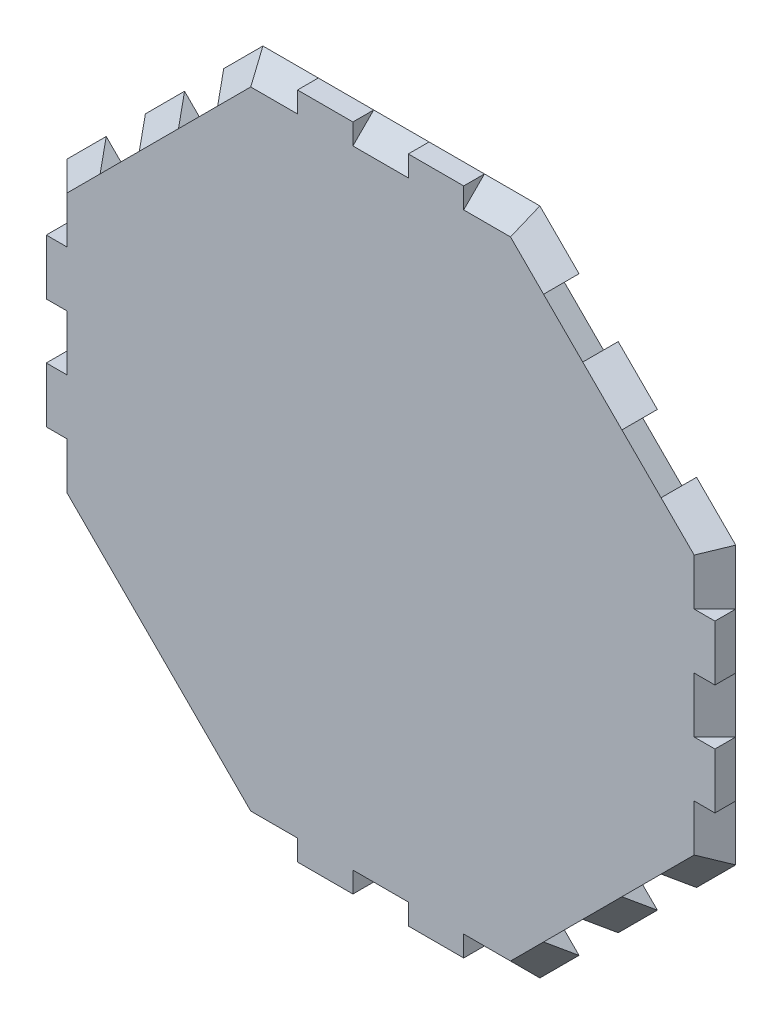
ISO-10303-21;
HEADER;
FILE_DESCRIPTION(('STEP AP214'),'2;1');
FILE_NAME('part.step','',(''),(''),'','','');
FILE_SCHEMA(('AUTOMOTIVE_DESIGN { 1 0 10303 214 1 1 1 1 }'));
ENDSEC;
DATA;
#1=APPLICATION_CONTEXT('core data for automotive mechanical design processes');
#2=APPLICATION_PROTOCOL_DEFINITION('international standard','automotive_design',2000,#1);
#3=PRODUCT_CONTEXT('',#1,'mechanical');
#4=PRODUCT('Part','Part','',(#3));
#5=PRODUCT_RELATED_PRODUCT_CATEGORY('part','',(#4));
#6=PRODUCT_DEFINITION_FORMATION('','',#4);
#7=PRODUCT_DEFINITION_CONTEXT('part definition',#1,'design');
#8=PRODUCT_DEFINITION('design','',#6,#7);
#9=PRODUCT_DEFINITION_SHAPE('','',#8);
#10=(LENGTH_UNIT() NAMED_UNIT(*) SI_UNIT(.MILLI.,.METRE.));
#11=(NAMED_UNIT(*) PLANE_ANGLE_UNIT() SI_UNIT($,.RADIAN.));
#12=(NAMED_UNIT(*) SI_UNIT($,.STERADIAN.) SOLID_ANGLE_UNIT());
#13=UNCERTAINTY_MEASURE_WITH_UNIT(LENGTH_MEASURE(1.E-05),#10,'distance_accuracy_value','');
#14=(GEOMETRIC_REPRESENTATION_CONTEXT(3) GLOBAL_UNCERTAINTY_ASSIGNED_CONTEXT((#13)) GLOBAL_UNIT_ASSIGNED_CONTEXT((#10,
#11,#12)) REPRESENTATION_CONTEXT('',''));
#15=CARTESIAN_POINT('',(0.,0.,0.));
#16=DIRECTION('',(0.,0.,1.));
#17=DIRECTION('',(1.,0.,0.));
#18=AXIS2_PLACEMENT_3D('',#15,#16,#17);
#19=CARTESIAN_POINT('',(32.0208152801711,32.0208152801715,3.));
#20=DIRECTION('',(0.499999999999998,0.500000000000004,0.707106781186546));
#21=DIRECTION('',(0.707106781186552,-0.707106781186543,0.));
#22=AXIS2_PLACEMENT_3D('',#19,#20,#21);
#23=PLANE('',#22);
#24=DIRECTION('',(0.499999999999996,0.500000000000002,-0.707106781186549));
#25=VECTOR('',#24,1.);
#26=CARTESIAN_POINT('',(40.5060966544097,23.535533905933,3.));
#27=LINE('',#26,#25);
#28=CARTESIAN_POINT('',(40.5060966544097,23.535533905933,3.));
#29=VERTEX_POINT('',#28);
#30=CARTESIAN_POINT('',(42.6274169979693,25.6568542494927,0.));
#31=VERTEX_POINT('',#30);
#32=EDGE_CURVE('E11',#29,#31,#27,.T.);
#33=ORIENTED_EDGE('',*,*,#32,.F.);
#34=DIRECTION('',(-0.707106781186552,0.707106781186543,0.));
#35=VECTOR('',#34,1.);
#36=CARTESIAN_POINT('',(17.87867965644,46.1629509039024,3.));
#37=LINE('',#36,#35);
#38=CARTESIAN_POINT('',(45.2842712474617,18.757359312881,3.));
#39=VERTEX_POINT('',#38);
#40=EDGE_CURVE('E467',#39,#29,#37,.T.);
#41=ORIENTED_EDGE('',*,*,#40,.F.);
#42=DIRECTION('',(0.678598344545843,0.281084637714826,-0.678598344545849));
#43=VECTOR('',#42,1.);
#44=CARTESIAN_POINT('',(41.7064255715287,17.2753671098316,6.57784567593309));
#45=LINE('',#44,#43);
#46=CARTESIAN_POINT('',(48.2842712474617,20.0000000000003,0.));
#47=VERTEX_POINT('',#46);
#48=EDGE_CURVE('E594',#47,#39,#45,.F.);
#49=ORIENTED_EDGE('',*,*,#48,.F.);
#50=DIRECTION('',(-0.707106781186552,0.707106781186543,0.));
#51=VECTOR('',#50,1.);
#52=CARTESIAN_POINT('',(48.2842712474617,20.0000000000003,0.));
#53=LINE('',#52,#51);
#54=EDGE_CURVE('E567',#47,#31,#53,.T.);
#55=ORIENTED_EDGE('',*,*,#54,.T.);
#56=EDGE_LOOP('',(#33,#41,#49,#55));
#57=FACE_BOUND('',#56,.T.);
#58=ADVANCED_FACE('F32',(#57),#23,.T.);
#59=DIRECTION('',(-0.499999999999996,-0.500000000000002,0.707106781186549));
#60=VECTOR('',#59,1.);
#61=CARTESIAN_POINT('',(34.8492424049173,29.1923881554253,3.));
#62=LINE('',#61,#60);
#63=CARTESIAN_POINT('',(36.9705627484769,31.313708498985,0.));
#64=VERTEX_POINT('',#63);
#65=CARTESIAN_POINT('',(34.8492424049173,29.1923881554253,3.));
#66=VERTEX_POINT('',#65);
#67=EDGE_CURVE('E40',#64,#66,#62,.T.);
#68=ORIENTED_EDGE('',*,*,#67,.F.);
#69=CARTESIAN_POINT('',(31.3137084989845,36.9705627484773,0.));
#70=VERTEX_POINT('',#69);
#71=EDGE_CURVE('E571',#64,#70,#53,.T.);
#72=ORIENTED_EDGE('',*,*,#71,.T.);
#73=DIRECTION('',(0.499999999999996,0.500000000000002,-0.707106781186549));
#74=VECTOR('',#73,1.);
#75=CARTESIAN_POINT('',(29.1923881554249,34.8492424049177,3.));
#76=LINE('',#75,#74);
#77=CARTESIAN_POINT('',(29.1923881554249,34.8492424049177,3.));
#78=VERTEX_POINT('',#77);
#79=EDGE_CURVE('E662',#78,#70,#76,.T.);
#80=ORIENTED_EDGE('',*,*,#79,.F.);
#81=EDGE_CURVE('E471',#66,#78,#37,.T.);
#82=ORIENTED_EDGE('',*,*,#81,.F.);
#83=EDGE_LOOP('',(#68,#72,#80,#82));
#84=FACE_BOUND('',#83,.T.);
#85=ADVANCED_FACE('F672',(#84),#23,.T.);
#86=CARTESIAN_POINT('',(-32.0208152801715,32.0208152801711,3.));
#87=DIRECTION('',(-0.500000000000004,0.499999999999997,0.707106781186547));
#88=DIRECTION('',(0.707106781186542,0.707106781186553,0.));
#89=AXIS2_PLACEMENT_3D('',#86,#87,#88);
#90=PLANE('',#89);
#91=DIRECTION('',(0.499999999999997,-0.500000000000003,0.707106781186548));
#92=VECTOR('',#91,1.);
#93=CARTESIAN_POINT('',(-40.5060966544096,23.5355339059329,2.99999999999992));
#94=LINE('',#93,#92);
#95=CARTESIAN_POINT('',(-42.6274169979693,25.6568542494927,0.));
#96=VERTEX_POINT('',#95);
#97=CARTESIAN_POINT('',(-40.5060966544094,23.535533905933,3.));
#98=VERTEX_POINT('',#97);
#99=EDGE_CURVE('E657',#96,#98,#94,.T.);
#100=ORIENTED_EDGE('',*,*,#99,.F.);
#101=DIRECTION('',(-0.707106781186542,-0.707106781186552,0.));
#102=VECTOR('',#101,1.);
#103=CARTESIAN_POINT('',(-20.0000000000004,48.2842712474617,0.));
#104=LINE('',#103,#102);
#105=CARTESIAN_POINT('',(-48.284271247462,19.9999999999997,0.));
#106=VERTEX_POINT('',#105);
#107=EDGE_CURVE('E548',#96,#106,#104,.T.);
#108=ORIENTED_EDGE('',*,*,#107,.T.);
#109=DIRECTION('',(0.678598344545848,-0.281084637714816,0.678598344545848));
#110=VECTOR('',#109,1.);
#111=CARTESIAN_POINT('',(-41.7064255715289,17.275367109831,6.57784567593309));
#112=LINE('',#111,#110);
#113=CARTESIAN_POINT('',(-45.284271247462,18.7573593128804,3.));
#114=VERTEX_POINT('',#113);
#115=EDGE_CURVE('E941',#114,#106,#112,.F.);
#116=ORIENTED_EDGE('',*,*,#115,.F.);
#117=DIRECTION('',(-0.707106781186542,-0.707106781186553,0.));
#118=VECTOR('',#117,1.);
#119=CARTESIAN_POINT('',(-46.1629509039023,17.87867965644,3.));
#120=LINE('',#119,#118);
#121=EDGE_CURVE('E492',#98,#114,#120,.T.);
#122=ORIENTED_EDGE('',*,*,#121,.F.);
#123=EDGE_LOOP('',(#100,#108,#116,#122));
#124=FACE_BOUND('',#123,.T.);
#125=ADVANCED_FACE('F1005',(#124),#90,.T.);
#126=DIRECTION('',(-0.499999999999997,0.500000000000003,-0.707106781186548));
#127=VECTOR('',#126,1.);
#128=CARTESIAN_POINT('',(-23.5355339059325,40.5060966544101,3.00000000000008));
#129=LINE('',#128,#127);
#130=CARTESIAN_POINT('',(-23.5355339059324,40.50609665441,3.));
#131=VERTEX_POINT('',#130);
#132=CARTESIAN_POINT('',(-25.6568542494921,42.6274169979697,0.));
#133=VERTEX_POINT('',#132);
#134=EDGE_CURVE('E653',#131,#133,#129,.T.);
#135=ORIENTED_EDGE('',*,*,#134,.F.);
#136=CARTESIAN_POINT('',(-18.757359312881,45.2842712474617,3.));
#137=VERTEX_POINT('',#136);
#138=EDGE_CURVE('E487',#137,#131,#120,.T.);
#139=ORIENTED_EDGE('',*,*,#138,.F.);
#140=DIRECTION('',(-0.281084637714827,0.678598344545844,-0.678598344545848));
#141=VECTOR('',#140,1.);
#142=CARTESIAN_POINT('',(-17.2753671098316,41.7064255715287,6.57784567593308));
#143=LINE('',#142,#141);
#144=CARTESIAN_POINT('',(-20.0000000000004,48.2842712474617,0.));
#145=VERTEX_POINT('',#144);
#146=EDGE_CURVE('E596',#137,#145,#143,.T.);
#147=ORIENTED_EDGE('',*,*,#146,.T.);
#148=EDGE_CURVE('E543',#145,#133,#104,.T.);
#149=ORIENTED_EDGE('',*,*,#148,.T.);
#150=EDGE_LOOP('',(#135,#139,#147,#149));
#151=FACE_BOUND('',#150,.T.);
#152=ADVANCED_FACE('F999',(#151),#90,.T.);
#153=CARTESIAN_POINT('',(32.0208152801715,-32.0208152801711,3.));
#154=DIRECTION('',(0.500000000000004,-0.499999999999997,0.707106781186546));
#155=DIRECTION('',(-0.707106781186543,-0.707106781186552,0.));
#156=AXIS2_PLACEMENT_3D('',#153,#154,#155);
#157=PLANE('',#156);
#158=DIRECTION('',(-0.499999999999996,0.500000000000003,0.707106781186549));
#159=VECTOR('',#158,1.);
#160=CARTESIAN_POINT('',(40.5060966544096,-23.5355339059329,2.99999999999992));
#161=LINE('',#160,#159);
#162=CARTESIAN_POINT('',(42.6274169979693,-25.6568542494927,0.));
#163=VERTEX_POINT('',#162);
#164=CARTESIAN_POINT('',(40.5060966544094,-23.535533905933,3.));
#165=VERTEX_POINT('',#164);
#166=EDGE_CURVE('E647',#163,#165,#161,.T.);
#167=ORIENTED_EDGE('',*,*,#166,.F.);
#168=DIRECTION('',(0.707106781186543,0.707106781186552,0.));
#169=VECTOR('',#168,1.);
#170=CARTESIAN_POINT('',(20.0000000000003,-48.2842712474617,0.));
#171=LINE('',#170,#169);
#172=CARTESIAN_POINT('',(48.284271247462,-19.9999999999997,0.));
#173=VERTEX_POINT('',#172);
#174=EDGE_CURVE('E503',#163,#173,#171,.T.);
#175=ORIENTED_EDGE('',*,*,#174,.T.);
#176=DIRECTION('',(0.678598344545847,-0.281084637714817,-0.678598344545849));
#177=VECTOR('',#176,1.);
#178=CARTESIAN_POINT('',(41.7064255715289,-17.275367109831,6.57784567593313));
#179=LINE('',#178,#177);
#180=CARTESIAN_POINT('',(45.284271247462,-18.7573593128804,3.));
#181=VERTEX_POINT('',#180);
#182=EDGE_CURVE('E939',#173,#181,#179,.F.);
#183=ORIENTED_EDGE('',*,*,#182,.T.);
#184=DIRECTION('',(0.707106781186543,0.707106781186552,0.));
#185=VECTOR('',#184,1.);
#186=CARTESIAN_POINT('',(46.1629509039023,-17.87867965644,3.));
#187=LINE('',#186,#185);
#188=EDGE_CURVE('E453',#165,#181,#187,.T.);
#189=ORIENTED_EDGE('',*,*,#188,.F.);
#190=EDGE_LOOP('',(#167,#175,#183,#189));
#191=FACE_BOUND('',#190,.T.);
#192=ADVANCED_FACE('F997',(#191),#157,.T.);
#193=DIRECTION('',(0.499999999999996,-0.500000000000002,-0.707106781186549));
#194=VECTOR('',#193,1.);
#195=CARTESIAN_POINT('',(23.5355339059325,-40.5060966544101,3.00000000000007));
#196=LINE('',#195,#194);
#197=CARTESIAN_POINT('',(23.5355339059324,-40.50609665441,3.));
#198=VERTEX_POINT('',#197);
#199=CARTESIAN_POINT('',(25.6568542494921,-42.6274169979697,0.));
#200=VERTEX_POINT('',#199);
#201=EDGE_CURVE('E643',#198,#200,#196,.T.);
#202=ORIENTED_EDGE('',*,*,#201,.F.);
#203=CARTESIAN_POINT('',(18.757359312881,-45.2842712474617,3.));
#204=VERTEX_POINT('',#203);
#205=EDGE_CURVE('E448',#204,#198,#187,.T.);
#206=ORIENTED_EDGE('',*,*,#205,.F.);
#207=DIRECTION('',(0.281084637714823,-0.678598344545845,-0.678598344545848));
#208=VECTOR('',#207,1.);
#209=CARTESIAN_POINT('',(17.2753671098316,-41.7064255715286,6.57784567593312));
#210=LINE('',#209,#208);
#211=CARTESIAN_POINT('',(20.0000000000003,-48.2842712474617,0.));
#212=VERTEX_POINT('',#211);
#213=EDGE_CURVE('E943',#212,#204,#210,.F.);
#214=ORIENTED_EDGE('',*,*,#213,.F.);
#215=EDGE_CURVE('E497',#212,#200,#171,.T.);
#216=ORIENTED_EDGE('',*,*,#215,.T.);
#217=EDGE_LOOP('',(#202,#206,#214,#216));
#218=FACE_BOUND('',#217,.T.);
#219=ADVANCED_FACE('F973',(#218),#157,.T.);
#220=CARTESIAN_POINT('',(-32.0208152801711,-32.0208152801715,3.));
#221=DIRECTION('',(-0.499999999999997,-0.500000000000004,0.707106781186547));
#222=DIRECTION('',(-0.707106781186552,0.707106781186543,0.));
#223=AXIS2_PLACEMENT_3D('',#220,#221,#222);
#224=PLANE('',#223);
#225=DIRECTION('',(0.499999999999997,0.500000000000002,0.707106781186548));
#226=VECTOR('',#225,1.);
#227=CARTESIAN_POINT('',(-23.5355339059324,-40.50609665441,2.99999999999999));
#228=LINE('',#227,#226);
#229=CARTESIAN_POINT('',(-25.6568542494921,-42.6274169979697,0.));
#230=VERTEX_POINT('',#229);
#231=CARTESIAN_POINT('',(-23.5355339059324,-40.50609665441,3.));
#232=VERTEX_POINT('',#231);
#233=EDGE_CURVE('E637',#230,#232,#228,.T.);
#234=ORIENTED_EDGE('',*,*,#233,.F.);
#235=DIRECTION('',(0.707106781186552,-0.707106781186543,0.));
#236=VECTOR('',#235,1.);
#237=CARTESIAN_POINT('',(-48.2842712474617,-20.0000000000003,0.));
#238=LINE('',#237,#236);
#239=CARTESIAN_POINT('',(-19.9999999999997,-48.284271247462,0.));
#240=VERTEX_POINT('',#239);
#241=EDGE_CURVE('E528',#230,#240,#238,.T.);
#242=ORIENTED_EDGE('',*,*,#241,.T.);
#243=DIRECTION('',(-0.281084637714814,-0.678598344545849,-0.678598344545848));
#244=VECTOR('',#243,1.);
#245=CARTESIAN_POINT('',(-17.275367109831,-41.7064255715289,6.5778456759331));
#246=LINE('',#245,#244);
#247=CARTESIAN_POINT('',(-18.7573593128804,-45.284271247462,3.));
#248=VERTEX_POINT('',#247);
#249=EDGE_CURVE('E880',#240,#248,#246,.F.);
#250=ORIENTED_EDGE('',*,*,#249,.T.);
#251=DIRECTION('',(0.707106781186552,-0.707106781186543,0.));
#252=VECTOR('',#251,1.);
#253=CARTESIAN_POINT('',(-17.87867965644,-46.1629509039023,3.));
#254=LINE('',#253,#252);
#255=EDGE_CURVE('E425',#232,#248,#254,.T.);
#256=ORIENTED_EDGE('',*,*,#255,.F.);
#257=EDGE_LOOP('',(#234,#242,#250,#256));
#258=FACE_BOUND('',#257,.T.);
#259=ADVANCED_FACE('F948',(#258),#224,.T.);
#260=DIRECTION('',(-0.499999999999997,-0.500000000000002,-0.707106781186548));
#261=VECTOR('',#260,1.);
#262=CARTESIAN_POINT('',(-29.1923881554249,-34.8492424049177,3.));
#263=LINE('',#262,#261);
#264=CARTESIAN_POINT('',(-29.1923881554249,-34.8492424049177,3.));
#265=VERTEX_POINT('',#264);
#266=CARTESIAN_POINT('',(-31.3137084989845,-36.9705627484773,0.));
#267=VERTEX_POINT('',#266);
#268=EDGE_CURVE('E635',#265,#267,#263,.T.);
#269=ORIENTED_EDGE('',*,*,#268,.F.);
#270=CARTESIAN_POINT('',(-34.8492424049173,-29.1923881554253,3.));
#271=VERTEX_POINT('',#270);
#272=EDGE_CURVE('E423',#271,#265,#254,.T.);
#273=ORIENTED_EDGE('',*,*,#272,.F.);
#274=DIRECTION('',(0.499999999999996,0.500000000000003,0.707106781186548));
#275=VECTOR('',#274,1.);
#276=CARTESIAN_POINT('',(-34.8492424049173,-29.1923881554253,3.));
#277=LINE('',#276,#275);
#278=CARTESIAN_POINT('',(-36.9705627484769,-31.313708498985,0.));
#279=VERTEX_POINT('',#278);
#280=EDGE_CURVE('E414',#279,#271,#277,.T.);
#281=ORIENTED_EDGE('',*,*,#280,.F.);
#282=EDGE_CURVE('E527',#279,#267,#238,.T.);
#283=ORIENTED_EDGE('',*,*,#282,.T.);
#284=EDGE_LOOP('',(#269,#273,#281,#283));
#285=FACE_BOUND('',#284,.T.);
#286=ADVANCED_FACE('F1031',(#285),#224,.T.);
#287=CARTESIAN_POINT('',(-45.2842712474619,-3.14222753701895E-13,3.));
#288=DIRECTION('',(-0.707106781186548,0.,0.707106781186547));
#289=DIRECTION('',(0.,1.,0.));
#290=AXIS2_PLACEMENT_3D('',#287,#288,#289);
#291=PLANE('',#290);
#292=DIRECTION('',(-0.707106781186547,0.,-0.707106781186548));
#293=VECTOR('',#292,1.);
#294=CARTESIAN_POINT('',(-45.284271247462,11.9999999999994,2.99999999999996));
#295=LINE('',#294,#293);
#296=CARTESIAN_POINT('',(-45.284271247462,11.9999999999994,3.));
#297=VERTEX_POINT('',#296);
#298=CARTESIAN_POINT('',(-48.284271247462,11.9999999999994,0.));
#299=VERTEX_POINT('',#298);
#300=EDGE_CURVE('E415',#297,#299,#295,.T.);
#301=ORIENTED_EDGE('',*,*,#300,.F.);
#302=DIRECTION('',(0.,-1.,0.));
#303=VECTOR('',#302,1.);
#304=CARTESIAN_POINT('',(-45.2842712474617,-20.0000000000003,3.));
#305=LINE('',#304,#303);
#306=EDGE_CURVE('E431',#114,#297,#305,.T.);
#307=ORIENTED_EDGE('',*,*,#306,.F.);
#308=ORIENTED_EDGE('',*,*,#115,.T.);
#309=DIRECTION('',(0.,-1.,0.));
#310=VECTOR('',#309,1.);
#311=CARTESIAN_POINT('',(-48.284271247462,19.9999999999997,0.));
#312=LINE('',#311,#310);
#313=EDGE_CURVE('E531',#106,#299,#312,.T.);
#314=ORIENTED_EDGE('',*,*,#313,.T.);
#315=EDGE_LOOP('',(#301,#307,#308,#314));
#316=FACE_BOUND('',#315,.T.);
#317=ADVANCED_FACE('F1035',(#316),#291,.T.);
#318=CARTESIAN_POINT('',(45.2842712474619,3.06367184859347E-13,3.));
#319=DIRECTION('',(0.70710678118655,0.,0.707106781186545));
#320=DIRECTION('',(0.,-1.,0.));
#321=AXIS2_PLACEMENT_3D('',#318,#319,#320);
#322=PLANE('',#321);
#323=DIRECTION('',(-0.707106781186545,0.,0.70710678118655));
#324=VECTOR('',#323,1.);
#325=CARTESIAN_POINT('',(45.2842712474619,-4.,3.00000000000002));
#326=LINE('',#325,#324);
#327=CARTESIAN_POINT('',(48.284271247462,-4.,0.));
#328=VERTEX_POINT('',#327);
#329=CARTESIAN_POINT('',(45.2842712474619,-4.,3.));
#330=VERTEX_POINT('',#329);
#331=EDGE_CURVE('E627',#328,#330,#326,.T.);
#332=ORIENTED_EDGE('',*,*,#331,.F.);
#333=DIRECTION('',(0.,1.,0.));
#334=VECTOR('',#333,1.);
#335=CARTESIAN_POINT('',(48.284271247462,-19.9999999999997,0.));
#336=LINE('',#335,#334);
#337=CARTESIAN_POINT('',(48.2842712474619,4.,0.));
#338=VERTEX_POINT('',#337);
#339=EDGE_CURVE('E584',#328,#338,#336,.T.);
#340=ORIENTED_EDGE('',*,*,#339,.T.);
#341=DIRECTION('',(0.707106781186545,0.,-0.70710678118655));
#342=VECTOR('',#341,1.);
#343=CARTESIAN_POINT('',(45.2842712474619,4.,2.99999999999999));
#344=LINE('',#343,#342);
#345=CARTESIAN_POINT('',(45.2842712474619,4.,3.));
#346=VERTEX_POINT('',#345);
#347=EDGE_CURVE('E619',#346,#338,#344,.T.);
#348=ORIENTED_EDGE('',*,*,#347,.F.);
#349=DIRECTION('',(0.,1.,0.));
#350=VECTOR('',#349,1.);
#351=CARTESIAN_POINT('',(45.2842712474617,20.0000000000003,3.));
#352=LINE('',#351,#350);
#353=EDGE_CURVE('E462',#330,#346,#352,.T.);
#354=ORIENTED_EDGE('',*,*,#353,.F.);
#355=EDGE_LOOP('',(#332,#340,#348,#354));
#356=FACE_BOUND('',#355,.T.);
#357=ADVANCED_FACE('F930',(#356),#322,.T.);
#358=DIRECTION('',(-0.707106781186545,0.,0.70710678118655));
#359=VECTOR('',#358,1.);
#360=CARTESIAN_POINT('',(45.2842712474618,12.,2.99999999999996));
#361=LINE('',#360,#359);
#362=CARTESIAN_POINT('',(48.2842712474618,12.,0.));
#363=VERTEX_POINT('',#362);
#364=CARTESIAN_POINT('',(45.2842712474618,12.,3.));
#365=VERTEX_POINT('',#364);
#366=EDGE_CURVE('E622',#363,#365,#361,.T.);
#367=ORIENTED_EDGE('',*,*,#366,.F.);
#368=EDGE_CURVE('E585',#363,#47,#336,.T.);
#369=ORIENTED_EDGE('',*,*,#368,.T.);
#370=ORIENTED_EDGE('',*,*,#48,.T.);
#371=EDGE_CURVE('E463',#365,#39,#352,.T.);
#372=ORIENTED_EDGE('',*,*,#371,.F.);
#373=EDGE_LOOP('',(#367,#369,#370,#372));
#374=FACE_BOUND('',#373,.T.);
#375=ADVANCED_FACE('F917',(#374),#322,.T.);
#376=CARTESIAN_POINT('',(3.22078322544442E-13,-45.2842712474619,3.));
#377=DIRECTION('',(0.,-0.707106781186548,0.707106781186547));
#378=DIRECTION('',(-1.,0.,0.));
#379=AXIS2_PLACEMENT_3D('',#376,#377,#378);
#380=PLANE('',#379);
#381=DIRECTION('',(0.,-0.707106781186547,-0.707106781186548));
#382=VECTOR('',#381,1.);
#383=CARTESIAN_POINT('',(-11.9999999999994,-45.284271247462,2.99999999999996));
#384=LINE('',#383,#382);
#385=CARTESIAN_POINT('',(-11.9999999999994,-45.2842712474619,3.));
#386=VERTEX_POINT('',#385);
#387=CARTESIAN_POINT('',(-11.9999999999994,-48.284271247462,0.));
#388=VERTEX_POINT('',#387);
#389=EDGE_CURVE('E617',#386,#388,#384,.T.);
#390=ORIENTED_EDGE('',*,*,#389,.F.);
#391=DIRECTION('',(1.,0.,0.));
#392=VECTOR('',#391,1.);
#393=CARTESIAN_POINT('',(20.0000000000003,-45.2842712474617,3.));
#394=LINE('',#393,#392);
#395=EDGE_CURVE('E441',#248,#386,#394,.T.);
#396=ORIENTED_EDGE('',*,*,#395,.F.);
#397=ORIENTED_EDGE('',*,*,#249,.F.);
#398=DIRECTION('',(1.,0.,0.));
#399=VECTOR('',#398,1.);
#400=CARTESIAN_POINT('',(-19.9999999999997,-48.284271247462,0.));
#401=LINE('',#400,#399);
#402=EDGE_CURVE('E510',#240,#388,#401,.T.);
#403=ORIENTED_EDGE('',*,*,#402,.T.);
#404=EDGE_LOOP('',(#390,#396,#397,#403));
#405=FACE_BOUND('',#404,.T.);
#406=ADVANCED_FACE('F949',(#405),#380,.T.);
#407=DIRECTION('',(0.,0.707106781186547,0.707106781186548));
#408=VECTOR('',#407,1.);
#409=CARTESIAN_POINT('',(12.0000000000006,-45.2842712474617,3.00000000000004));
#410=LINE('',#409,#408);
#411=CARTESIAN_POINT('',(12.0000000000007,-48.2842712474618,0.));
#412=VERTEX_POINT('',#411);
#413=CARTESIAN_POINT('',(12.0000000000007,-45.2842712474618,3.));
#414=VERTEX_POINT('',#413);
#415=EDGE_CURVE('E611',#412,#414,#410,.T.);
#416=ORIENTED_EDGE('',*,*,#415,.F.);
#417=EDGE_CURVE('E518',#412,#212,#401,.T.);
#418=ORIENTED_EDGE('',*,*,#417,.T.);
#419=ORIENTED_EDGE('',*,*,#213,.T.);
#420=EDGE_CURVE('E443',#414,#204,#394,.T.);
#421=ORIENTED_EDGE('',*,*,#420,.F.);
#422=EDGE_LOOP('',(#416,#418,#419,#421));
#423=FACE_BOUND('',#422,.T.);
#424=ADVANCED_FACE('F972',(#423),#380,.T.);
#425=DIRECTION('',(0.707106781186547,0.,0.707106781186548));
#426=VECTOR('',#425,1.);
#427=CARTESIAN_POINT('',(-45.2842712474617,-12.0000000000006,3.00000000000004));
#428=LINE('',#427,#426);
#429=CARTESIAN_POINT('',(-48.2842712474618,-12.0000000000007,0.));
#430=VERTEX_POINT('',#429);
#431=CARTESIAN_POINT('',(-45.2842712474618,-12.0000000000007,3.));
#432=VERTEX_POINT('',#431);
#433=EDGE_CURVE('E605',#430,#432,#428,.T.);
#434=ORIENTED_EDGE('',*,*,#433,.F.);
#435=CARTESIAN_POINT('',(-48.2842712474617,-20.0000000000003,0.));
#436=VERTEX_POINT('',#435);
#437=EDGE_CURVE('E537',#430,#436,#312,.T.);
#438=ORIENTED_EDGE('',*,*,#437,.T.);
#439=DIRECTION('',(0.678598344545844,0.281084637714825,0.678598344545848));
#440=VECTOR('',#439,1.);
#441=CARTESIAN_POINT('',(-41.7064255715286,-17.2753671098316,6.57784567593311));
#442=LINE('',#441,#440);
#443=CARTESIAN_POINT('',(-45.2842712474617,-18.757359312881,3.));
#444=VERTEX_POINT('',#443);
#445=EDGE_CURVE('E947',#444,#436,#442,.F.);
#446=ORIENTED_EDGE('',*,*,#445,.F.);
#447=EDGE_CURVE('E420',#432,#444,#305,.T.);
#448=ORIENTED_EDGE('',*,*,#447,.F.);
#449=EDGE_LOOP('',(#434,#438,#446,#448));
#450=FACE_BOUND('',#449,.T.);
#451=ADVANCED_FACE('F1036',(#450),#291,.T.);
#452=CARTESIAN_POINT('',(-3.22078322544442E-13,45.2842712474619,3.));
#453=DIRECTION('',(0.,0.707106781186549,0.707106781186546));
#454=DIRECTION('',(1.,0.,0.));
#455=AXIS2_PLACEMENT_3D('',#452,#453,#454);
#456=PLANE('',#455);
#457=DIRECTION('',(0.,-0.707106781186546,0.707106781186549));
#458=VECTOR('',#457,1.);
#459=CARTESIAN_POINT('',(4.,45.2842712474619,3.00000000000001));
#460=LINE('',#459,#458);
#461=CARTESIAN_POINT('',(4.,48.284271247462,0.));
#462=VERTEX_POINT('',#461);
#463=CARTESIAN_POINT('',(4.,45.2842712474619,3.));
#464=VERTEX_POINT('',#463);
#465=EDGE_CURVE('E862',#462,#464,#460,.T.);
#466=ORIENTED_EDGE('',*,*,#465,.F.);
#467=DIRECTION('',(-1.,0.,0.));
#468=VECTOR('',#467,1.);
#469=CARTESIAN_POINT('',(19.9999999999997,48.284271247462,0.));
#470=LINE('',#469,#468);
#471=CARTESIAN_POINT('',(-4.,48.2842712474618,0.));
#472=VERTEX_POINT('',#471);
#473=EDGE_CURVE('E560',#462,#472,#470,.T.);
#474=ORIENTED_EDGE('',*,*,#473,.T.);
#475=DIRECTION('',(0.,0.707106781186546,-0.707106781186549));
#476=VECTOR('',#475,1.);
#477=CARTESIAN_POINT('',(-4.,45.2842712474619,2.99999999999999));
#478=LINE('',#477,#476);
#479=CARTESIAN_POINT('',(-4.,45.2842712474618,3.));
#480=VERTEX_POINT('',#479);
#481=EDGE_CURVE('E427',#480,#472,#478,.T.);
#482=ORIENTED_EDGE('',*,*,#481,.F.);
#483=DIRECTION('',(-1.,0.,0.));
#484=VECTOR('',#483,1.);
#485=CARTESIAN_POINT('',(-20.0000000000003,45.2842712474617,3.));
#486=LINE('',#485,#484);
#487=EDGE_CURVE('E481',#464,#480,#486,.T.);
#488=ORIENTED_EDGE('',*,*,#487,.F.);
#489=EDGE_LOOP('',(#466,#474,#482,#488));
#490=FACE_BOUND('',#489,.T.);
#491=ADVANCED_FACE('F897',(#490),#456,.T.);
#492=DIRECTION('',(0.,0.707106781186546,-0.707106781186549));
#493=VECTOR('',#492,1.);
#494=CARTESIAN_POINT('',(12.,45.2842712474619,3.00000000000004));
#495=LINE('',#494,#493);
#496=CARTESIAN_POINT('',(12.,45.284271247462,3.));
#497=VERTEX_POINT('',#496);
#498=CARTESIAN_POINT('',(12.,48.284271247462,0.));
#499=VERTEX_POINT('',#498);
#500=EDGE_CURVE('E858',#497,#499,#495,.T.);
#501=ORIENTED_EDGE('',*,*,#500,.F.);
#502=CARTESIAN_POINT('',(18.7573593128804,45.284271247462,3.));
#503=VERTEX_POINT('',#502);
#504=EDGE_CURVE('E476',#503,#497,#486,.T.);
#505=ORIENTED_EDGE('',*,*,#504,.F.);
#506=DIRECTION('',(0.281084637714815,0.678598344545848,-0.678598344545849));
#507=VECTOR('',#506,1.);
#508=CARTESIAN_POINT('',(17.275367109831,41.7064255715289,6.5778456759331));
#509=LINE('',#508,#507);
#510=CARTESIAN_POINT('',(19.9999999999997,48.284271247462,0.));
#511=VERTEX_POINT('',#510);
#512=EDGE_CURVE('E590',#503,#511,#509,.T.);
#513=ORIENTED_EDGE('',*,*,#512,.T.);
#514=EDGE_CURVE('E555',#511,#499,#470,.T.);
#515=ORIENTED_EDGE('',*,*,#514,.T.);
#516=EDGE_LOOP('',(#501,#505,#513,#515));
#517=FACE_BOUND('',#516,.T.);
#518=ADVANCED_FACE('F1021',(#517),#456,.T.);
#519=CARTESIAN_POINT('',(0.,0.,3.));
#520=DIRECTION('',(0.,0.,1.));
#521=DIRECTION('',(1.,0.,0.));
#522=AXIS2_PLACEMENT_3D('',#519,#520,#521);
#523=PLANE('',#522);
#524=ORIENTED_EDGE('',*,*,#306,.T.);
#525=DIRECTION('',(1.,0.,0.));
#526=VECTOR('',#525,1.);
#527=CARTESIAN_POINT('',(-45.2842712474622,11.9999999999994,3.));
#528=LINE('',#527,#526);
#529=CARTESIAN_POINT('',(-48.284271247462,11.9999999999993,3.));
#530=VERTEX_POINT('',#529);
#531=EDGE_CURVE('E743',#530,#297,#528,.T.);
#532=ORIENTED_EDGE('',*,*,#531,.F.);
#533=DIRECTION('',(0.,1.,0.));
#534=VECTOR('',#533,1.);
#535=CARTESIAN_POINT('',(-48.284271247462,11.9999999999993,3.));
#536=LINE('',#535,#534);
#537=CARTESIAN_POINT('',(-48.2842712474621,3.99999999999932,3.));
#538=VERTEX_POINT('',#537);
#539=EDGE_CURVE('E748',#538,#530,#536,.T.);
#540=ORIENTED_EDGE('',*,*,#539,.F.);
#541=DIRECTION('',(-1.,0.,0.));
#542=VECTOR('',#541,1.);
#543=CARTESIAN_POINT('',(-48.2842712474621,3.99999999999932,3.));
#544=LINE('',#543,#542);
#545=CARTESIAN_POINT('',(-45.2842712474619,3.99999999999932,3.));
#546=VERTEX_POINT('',#545);
#547=EDGE_CURVE('E745',#546,#538,#544,.T.);
#548=ORIENTED_EDGE('',*,*,#547,.F.);
#549=CARTESIAN_POINT('',(-45.2842712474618,-4.00000000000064,3.));
#550=VERTEX_POINT('',#549);
#551=EDGE_CURVE('E436',#546,#550,#305,.T.);
#552=ORIENTED_EDGE('',*,*,#551,.T.);
#553=DIRECTION('',(1.,0.,0.));
#554=VECTOR('',#553,1.);
#555=CARTESIAN_POINT('',(-48.284271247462,-4.00000000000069,3.));
#556=LINE('',#555,#554);
#557=CARTESIAN_POINT('',(-48.284271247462,-4.00000000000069,3.));
#558=VERTEX_POINT('',#557);
#559=EDGE_CURVE('E833',#558,#550,#556,.T.);
#560=ORIENTED_EDGE('',*,*,#559,.F.);
#561=DIRECTION('',(0.,1.,0.));
#562=VECTOR('',#561,1.);
#563=CARTESIAN_POINT('',(-48.2842712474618,-12.0000000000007,3.));
#564=LINE('',#563,#562);
#565=CARTESIAN_POINT('',(-48.2842712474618,-12.0000000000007,3.));
#566=VERTEX_POINT('',#565);
#567=EDGE_CURVE('E830',#566,#558,#564,.T.);
#568=ORIENTED_EDGE('',*,*,#567,.F.);
#569=DIRECTION('',(-1.,0.,0.));
#570=VECTOR('',#569,1.);
#571=CARTESIAN_POINT('',(-45.2842712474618,-12.0000000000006,3.));
#572=LINE('',#571,#570);
#573=EDGE_CURVE('E827',#432,#566,#572,.T.);
#574=ORIENTED_EDGE('',*,*,#573,.F.);
#575=ORIENTED_EDGE('',*,*,#447,.T.);
#576=CARTESIAN_POINT('',(-40.5060966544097,-23.535533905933,3.));
#577=VERTEX_POINT('',#576);
#578=EDGE_CURVE('E411',#444,#577,#254,.T.);
#579=ORIENTED_EDGE('',*,*,#578,.T.);
#580=DIRECTION('',(0.707106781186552,-0.707106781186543,0.));
#581=VECTOR('',#580,1.);
#582=CARTESIAN_POINT('',(-34.8492424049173,-29.1923881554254,3.));
#583=LINE('',#582,#581);
#584=EDGE_CURVE('E396',#577,#271,#583,.T.);
#585=ORIENTED_EDGE('',*,*,#584,.T.);
#586=ORIENTED_EDGE('',*,*,#272,.T.);
#587=DIRECTION('',(0.707106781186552,-0.707106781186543,0.));
#588=VECTOR('',#587,1.);
#589=CARTESIAN_POINT('',(-29.1923881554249,-34.8492424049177,3.));
#590=LINE('',#589,#588);
#591=EDGE_CURVE('E718',#265,#232,#590,.T.);
#592=ORIENTED_EDGE('',*,*,#591,.T.);
#593=ORIENTED_EDGE('',*,*,#255,.T.);
#594=ORIENTED_EDGE('',*,*,#395,.T.);
#595=DIRECTION('',(0.,1.,0.));
#596=VECTOR('',#595,1.);
#597=CARTESIAN_POINT('',(-11.9999999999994,-45.2842712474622,3.));
#598=LINE('',#597,#596);
#599=CARTESIAN_POINT('',(-11.9999999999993,-48.284271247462,3.));
#600=VERTEX_POINT('',#599);
#601=EDGE_CURVE('E793',#600,#386,#598,.T.);
#602=ORIENTED_EDGE('',*,*,#601,.F.);
#603=DIRECTION('',(-1.,0.,0.));
#604=VECTOR('',#603,1.);
#605=CARTESIAN_POINT('',(-11.9999999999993,-48.284271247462,3.));
#606=LINE('',#605,#604);
#607=CARTESIAN_POINT('',(-3.99999999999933,-48.2842712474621,3.));
#608=VERTEX_POINT('',#607);
#609=EDGE_CURVE('E798',#608,#600,#606,.T.);
#610=ORIENTED_EDGE('',*,*,#609,.F.);
#611=DIRECTION('',(0.,-1.,0.));
#612=VECTOR('',#611,1.);
#613=CARTESIAN_POINT('',(-3.99999999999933,-48.2842712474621,3.));
#614=LINE('',#613,#612);
#615=CARTESIAN_POINT('',(-3.99999999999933,-45.2842712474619,3.));
#616=VERTEX_POINT('',#615);
#617=EDGE_CURVE('E795',#616,#608,#614,.T.);
#618=ORIENTED_EDGE('',*,*,#617,.F.);
#619=CARTESIAN_POINT('',(4.00000000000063,-45.2842712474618,3.));
#620=VERTEX_POINT('',#619);
#621=EDGE_CURVE('E442',#616,#620,#394,.T.);
#622=ORIENTED_EDGE('',*,*,#621,.T.);
#623=DIRECTION('',(0.,1.,0.));
#624=VECTOR('',#623,1.);
#625=CARTESIAN_POINT('',(4.00000000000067,-48.284271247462,3.));
#626=LINE('',#625,#624);
#627=CARTESIAN_POINT('',(4.00000000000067,-48.284271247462,3.));
#628=VERTEX_POINT('',#627);
#629=EDGE_CURVE('E815',#628,#620,#626,.T.);
#630=ORIENTED_EDGE('',*,*,#629,.F.);
#631=DIRECTION('',(-1.,0.,0.));
#632=VECTOR('',#631,1.);
#633=CARTESIAN_POINT('',(12.0000000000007,-48.2842712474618,3.));
#634=LINE('',#633,#632);
#635=CARTESIAN_POINT('',(12.0000000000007,-48.2842712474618,3.));
#636=VERTEX_POINT('',#635);
#637=EDGE_CURVE('E812',#636,#628,#634,.T.);
#638=ORIENTED_EDGE('',*,*,#637,.F.);
#639=DIRECTION('',(0.,-1.,0.));
#640=VECTOR('',#639,1.);
#641=CARTESIAN_POINT('',(12.0000000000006,-45.2842712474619,3.));
#642=LINE('',#641,#640);
#643=EDGE_CURVE('E809',#414,#636,#642,.T.);
#644=ORIENTED_EDGE('',*,*,#643,.F.);
#645=ORIENTED_EDGE('',*,*,#420,.T.);
#646=ORIENTED_EDGE('',*,*,#205,.T.);
#647=DIRECTION('',(0.707106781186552,0.707106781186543,0.));
#648=VECTOR('',#647,1.);
#649=CARTESIAN_POINT('',(29.1923881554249,-34.8492424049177,3.));
#650=LINE('',#649,#648);
#651=CARTESIAN_POINT('',(29.1923881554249,-34.8492424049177,3.));
#652=VERTEX_POINT('',#651);
#653=EDGE_CURVE('E704',#198,#652,#650,.T.);
#654=ORIENTED_EDGE('',*,*,#653,.T.);
#655=CARTESIAN_POINT('',(34.8492424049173,-29.1923881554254,3.));
#656=VERTEX_POINT('',#655);
#657=EDGE_CURVE('E452',#652,#656,#187,.T.);
#658=ORIENTED_EDGE('',*,*,#657,.T.);
#659=DIRECTION('',(0.707106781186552,0.707106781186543,0.));
#660=VECTOR('',#659,1.);
#661=CARTESIAN_POINT('',(34.8492424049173,-29.1923881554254,3.));
#662=LINE('',#661,#660);
#663=EDGE_CURVE('E690',#656,#165,#662,.T.);
#664=ORIENTED_EDGE('',*,*,#663,.T.);
#665=ORIENTED_EDGE('',*,*,#188,.T.);
#666=CARTESIAN_POINT('',(45.284271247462,-12.,3.));
#667=VERTEX_POINT('',#666);
#668=EDGE_CURVE('E457',#181,#667,#352,.T.);
#669=ORIENTED_EDGE('',*,*,#668,.T.);
#670=DIRECTION('',(-1.,0.,0.));
#671=VECTOR('',#670,1.);
#672=CARTESIAN_POINT('',(45.284271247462,-12.,3.));
#673=LINE('',#672,#671);
#674=CARTESIAN_POINT('',(48.284271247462,-12.,3.));
#675=VERTEX_POINT('',#674);
#676=EDGE_CURVE('E762',#675,#667,#673,.T.);
#677=ORIENTED_EDGE('',*,*,#676,.F.);
#678=DIRECTION('',(0.,-1.,0.));
#679=VECTOR('',#678,1.);
#680=CARTESIAN_POINT('',(48.284271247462,-12.,3.));
#681=LINE('',#680,#679);
#682=CARTESIAN_POINT('',(48.284271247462,-4.,3.));
#683=VERTEX_POINT('',#682);
#684=EDGE_CURVE('E759',#683,#675,#681,.T.);
#685=ORIENTED_EDGE('',*,*,#684,.F.);
#686=DIRECTION('',(1.,0.,0.));
#687=VECTOR('',#686,1.);
#688=CARTESIAN_POINT('',(48.284271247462,-4.,3.));
#689=LINE('',#688,#687);
#690=EDGE_CURVE('E764',#330,#683,#689,.T.);
#691=ORIENTED_EDGE('',*,*,#690,.F.);
#692=ORIENTED_EDGE('',*,*,#353,.T.);
#693=DIRECTION('',(-1.,0.,0.));
#694=VECTOR('',#693,1.);
#695=CARTESIAN_POINT('',(48.284271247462,4.,3.));
#696=LINE('',#695,#694);
#697=CARTESIAN_POINT('',(48.284271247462,4.,3.));
#698=VERTEX_POINT('',#697);
#699=EDGE_CURVE('E778',#698,#346,#696,.T.);
#700=ORIENTED_EDGE('',*,*,#699,.F.);
#701=DIRECTION('',(0.,-1.,0.));
#702=VECTOR('',#701,1.);
#703=CARTESIAN_POINT('',(48.2842712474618,12.,3.));
#704=LINE('',#703,#702);
#705=CARTESIAN_POINT('',(48.2842712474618,12.,3.));
#706=VERTEX_POINT('',#705);
#707=EDGE_CURVE('E775',#706,#698,#704,.T.);
#708=ORIENTED_EDGE('',*,*,#707,.F.);
#709=DIRECTION('',(1.,0.,0.));
#710=VECTOR('',#709,1.);
#711=CARTESIAN_POINT('',(45.284271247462,12.,3.));
#712=LINE('',#711,#710);
#713=EDGE_CURVE('E781',#365,#706,#712,.T.);
#714=ORIENTED_EDGE('',*,*,#713,.F.);
#715=ORIENTED_EDGE('',*,*,#371,.T.);
#716=ORIENTED_EDGE('',*,*,#40,.T.);
#717=DIRECTION('',(-0.707106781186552,0.707106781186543,0.));
#718=VECTOR('',#717,1.);
#719=CARTESIAN_POINT('',(34.8492424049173,29.1923881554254,3.));
#720=LINE('',#719,#718);
#721=EDGE_CURVE('E673',#29,#66,#720,.T.);
#722=ORIENTED_EDGE('',*,*,#721,.T.);
#723=ORIENTED_EDGE('',*,*,#81,.T.);
#724=DIRECTION('',(-0.707106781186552,0.707106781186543,0.));
#725=VECTOR('',#724,1.);
#726=CARTESIAN_POINT('',(29.1923881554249,34.8492424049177,3.));
#727=LINE('',#726,#725);
#728=CARTESIAN_POINT('',(23.5355339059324,40.50609665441,3.));
#729=VERTEX_POINT('',#728);
#730=EDGE_CURVE('E731',#78,#729,#727,.T.);
#731=ORIENTED_EDGE('',*,*,#730,.T.);
#732=EDGE_CURVE('E472',#729,#503,#37,.T.);
#733=ORIENTED_EDGE('',*,*,#732,.T.);
#734=ORIENTED_EDGE('',*,*,#504,.T.);
#735=DIRECTION('',(0.,-1.,0.));
#736=VECTOR('',#735,1.);
#737=CARTESIAN_POINT('',(12.,45.284271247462,3.));
#738=LINE('',#737,#736);
#739=CARTESIAN_POINT('',(12.,48.284271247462,3.));
#740=VERTEX_POINT('',#739);
#741=EDGE_CURVE('E848',#740,#497,#738,.T.);
#742=ORIENTED_EDGE('',*,*,#741,.F.);
#743=DIRECTION('',(1.,0.,0.));
#744=VECTOR('',#743,1.);
#745=CARTESIAN_POINT('',(12.,48.284271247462,3.));
#746=LINE('',#745,#744);
#747=CARTESIAN_POINT('',(4.,48.284271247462,3.));
#748=VERTEX_POINT('',#747);
#749=EDGE_CURVE('E845',#748,#740,#746,.T.);
#750=ORIENTED_EDGE('',*,*,#749,.F.);
#751=DIRECTION('',(0.,1.,0.));
#752=VECTOR('',#751,1.);
#753=CARTESIAN_POINT('',(4.,48.284271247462,3.));
#754=LINE('',#753,#752);
#755=EDGE_CURVE('E850',#464,#748,#754,.T.);
#756=ORIENTED_EDGE('',*,*,#755,.F.);
#757=ORIENTED_EDGE('',*,*,#487,.T.);
#758=DIRECTION('',(0.,-1.,0.));
#759=VECTOR('',#758,1.);
#760=CARTESIAN_POINT('',(-4.,48.284271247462,3.));
#761=LINE('',#760,#759);
#762=CARTESIAN_POINT('',(-4.,48.284271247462,3.));
#763=VERTEX_POINT('',#762);
#764=EDGE_CURVE('E872',#763,#480,#761,.T.);
#765=ORIENTED_EDGE('',*,*,#764,.F.);
#766=DIRECTION('',(1.,0.,0.));
#767=VECTOR('',#766,1.);
#768=CARTESIAN_POINT('',(-12.,48.2842712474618,3.));
#769=LINE('',#768,#767);
#770=CARTESIAN_POINT('',(-12.,48.2842712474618,3.));
#771=VERTEX_POINT('',#770);
#772=EDGE_CURVE('E869',#771,#763,#769,.T.);
#773=ORIENTED_EDGE('',*,*,#772,.F.);
#774=DIRECTION('',(0.,1.,0.));
#775=VECTOR('',#774,1.);
#776=CARTESIAN_POINT('',(-12.,45.284271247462,3.));
#777=LINE('',#776,#775);
#778=CARTESIAN_POINT('',(-12.,45.2842712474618,3.));
#779=VERTEX_POINT('',#778);
#780=EDGE_CURVE('E866',#779,#771,#777,.T.);
#781=ORIENTED_EDGE('',*,*,#780,.F.);
#782=EDGE_CURVE('E482',#779,#137,#486,.T.);
#783=ORIENTED_EDGE('',*,*,#782,.T.);
#784=ORIENTED_EDGE('',*,*,#138,.T.);
#785=DIRECTION('',(-0.707106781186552,-0.707106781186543,0.));
#786=VECTOR('',#785,1.);
#787=CARTESIAN_POINT('',(-29.1923881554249,34.8492424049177,3.));
#788=LINE('',#787,#786);
#789=CARTESIAN_POINT('',(-29.1923881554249,34.8492424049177,3.));
#790=VERTEX_POINT('',#789);
#791=EDGE_CURVE('E1085',#131,#790,#788,.T.);
#792=ORIENTED_EDGE('',*,*,#791,.T.);
#793=CARTESIAN_POINT('',(-34.8492424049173,29.1923881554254,3.));
#794=VERTEX_POINT('',#793);
#795=EDGE_CURVE('E491',#790,#794,#120,.T.);
#796=ORIENTED_EDGE('',*,*,#795,.T.);
#797=DIRECTION('',(-0.707106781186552,-0.707106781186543,0.));
#798=VECTOR('',#797,1.);
#799=CARTESIAN_POINT('',(-34.8492424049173,29.1923881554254,3.));
#800=LINE('',#799,#798);
#801=EDGE_CURVE('E1065',#794,#98,#800,.T.);
#802=ORIENTED_EDGE('',*,*,#801,.T.);
#803=ORIENTED_EDGE('',*,*,#121,.T.);
#804=EDGE_LOOP('',(#524,#532,#540,#548,#552,#560,#568,#574,#575,#579,#585,#586,#592,#593,#594,
#602,#610,#618,#622,#630,#638,#644,#645,#646,#654,#658,#664,#665,#669,#677,#685,#691,#692,#700,
#708,#714,#715,#716,#722,#723,#731,#733,#734,#742,#750,#756,#757,#765,#773,#781,#783,#784,#792,
#796,#802,#803));
#805=FACE_BOUND('',#804,.T.);
#806=ADVANCED_FACE('F418',(#805),#523,.T.);
#807=CARTESIAN_POINT('',(0.,0.,0.));
#808=DIRECTION('',(0.,0.,1.));
#809=DIRECTION('',(1.,0.,0.));
#810=AXIS2_PLACEMENT_3D('',#807,#808,#809);
#811=PLANE('',#810);
#812=DIRECTION('',(-0.707106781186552,0.707106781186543,0.));
#813=VECTOR('',#812,1.);
#814=CARTESIAN_POINT('',(34.8492424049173,29.1923881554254,0.));
#815=LINE('',#814,#813);
#816=CARTESIAN_POINT('',(40.5060966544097,23.535533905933,0.));
#817=VERTEX_POINT('',#816);
#818=CARTESIAN_POINT('',(34.8492424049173,29.1923881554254,0.));
#819=VERTEX_POINT('',#818);
#820=EDGE_CURVE('E684',#817,#819,#815,.T.);
#821=ORIENTED_EDGE('',*,*,#820,.F.);
#822=DIRECTION('',(-0.707106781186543,-0.707106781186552,0.));
#823=VECTOR('',#822,1.);
#824=CARTESIAN_POINT('',(40.5060966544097,23.535533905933,0.));
#825=LINE('',#824,#823);
#826=EDGE_CURVE('E674',#31,#817,#825,.T.);
#827=ORIENTED_EDGE('',*,*,#826,.F.);
#828=ORIENTED_EDGE('',*,*,#54,.F.);
#829=ORIENTED_EDGE('',*,*,#368,.F.);
#830=DIRECTION('',(0.,-1.,0.));
#831=VECTOR('',#830,1.);
#832=CARTESIAN_POINT('',(48.2842712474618,12.,0.));
#833=LINE('',#832,#831);
#834=EDGE_CURVE('E772',#363,#338,#833,.T.);
#835=ORIENTED_EDGE('',*,*,#834,.T.);
#836=ORIENTED_EDGE('',*,*,#339,.F.);
#837=DIRECTION('',(0.,-1.,0.));
#838=VECTOR('',#837,1.);
#839=CARTESIAN_POINT('',(48.284271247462,-12.,0.));
#840=LINE('',#839,#838);
#841=CARTESIAN_POINT('',(48.284271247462,-12.,0.));
#842=VERTEX_POINT('',#841);
#843=EDGE_CURVE('E756',#328,#842,#840,.T.);
#844=ORIENTED_EDGE('',*,*,#843,.T.);
#845=EDGE_CURVE('E579',#173,#842,#336,.T.);
#846=ORIENTED_EDGE('',*,*,#845,.F.);
#847=ORIENTED_EDGE('',*,*,#174,.F.);
#848=DIRECTION('',(0.707106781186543,-0.707106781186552,0.));
#849=VECTOR('',#848,1.);
#850=CARTESIAN_POINT('',(40.5060966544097,-23.535533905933,0.));
#851=LINE('',#850,#849);
#852=CARTESIAN_POINT('',(40.5060966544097,-23.535533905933,0.));
#853=VERTEX_POINT('',#852);
#854=EDGE_CURVE('E694',#853,#163,#851,.T.);
#855=ORIENTED_EDGE('',*,*,#854,.F.);
#856=DIRECTION('',(0.707106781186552,0.707106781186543,0.));
#857=VECTOR('',#856,1.);
#858=CARTESIAN_POINT('',(34.8492424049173,-29.1923881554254,0.));
#859=LINE('',#858,#857);
#860=CARTESIAN_POINT('',(34.8492424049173,-29.1923881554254,0.));
#861=VERTEX_POINT('',#860);
#862=EDGE_CURVE('E693',#861,#853,#859,.T.);
#863=ORIENTED_EDGE('',*,*,#862,.F.);
#864=DIRECTION('',(-0.707106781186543,0.707106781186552,0.));
#865=VECTOR('',#864,1.);
#866=CARTESIAN_POINT('',(36.9705627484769,-31.313708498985,0.));
#867=LINE('',#866,#865);
#868=CARTESIAN_POINT('',(36.9705627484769,-31.313708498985,0.));
#869=VERTEX_POINT('',#868);
#870=EDGE_CURVE('E696',#869,#861,#867,.T.);
#871=ORIENTED_EDGE('',*,*,#870,.F.);
#872=CARTESIAN_POINT('',(31.3137084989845,-36.9705627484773,0.));
#873=VERTEX_POINT('',#872);
#874=EDGE_CURVE('E502',#873,#869,#171,.T.);
#875=ORIENTED_EDGE('',*,*,#874,.F.);
#876=DIRECTION('',(0.707106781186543,-0.707106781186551,0.));
#877=VECTOR('',#876,1.);
#878=CARTESIAN_POINT('',(31.3137084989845,-36.9705627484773,0.));
#879=LINE('',#878,#877);
#880=CARTESIAN_POINT('',(29.1923881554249,-34.8492424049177,0.));
#881=VERTEX_POINT('',#880);
#882=EDGE_CURVE('E707',#881,#873,#879,.T.);
#883=ORIENTED_EDGE('',*,*,#882,.F.);
#884=DIRECTION('',(0.707106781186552,0.707106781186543,0.));
#885=VECTOR('',#884,1.);
#886=CARTESIAN_POINT('',(29.1923881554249,-34.8492424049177,0.));
#887=LINE('',#886,#885);
#888=CARTESIAN_POINT('',(23.5355339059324,-40.50609665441,0.));
#889=VERTEX_POINT('',#888);
#890=EDGE_CURVE('E711',#889,#881,#887,.T.);
#891=ORIENTED_EDGE('',*,*,#890,.F.);
#892=DIRECTION('',(-0.707106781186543,0.707106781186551,0.));
#893=VECTOR('',#892,1.);
#894=CARTESIAN_POINT('',(23.5355339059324,-40.50609665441,0.));
#895=LINE('',#894,#893);
#896=EDGE_CURVE('E708',#200,#889,#895,.T.);
#897=ORIENTED_EDGE('',*,*,#896,.F.);
#898=ORIENTED_EDGE('',*,*,#215,.F.);
#899=ORIENTED_EDGE('',*,*,#417,.F.);
#900=DIRECTION('',(-1.,0.,0.));
#901=VECTOR('',#900,1.);
#902=CARTESIAN_POINT('',(12.0000000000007,-48.2842712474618,0.));
#903=LINE('',#902,#901);
#904=CARTESIAN_POINT('',(4.00000000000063,-48.2842712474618,0.));
#905=VERTEX_POINT('',#904);
#906=EDGE_CURVE('E806',#412,#905,#903,.T.);
#907=ORIENTED_EDGE('',*,*,#906,.T.);
#908=CARTESIAN_POINT('',(-3.99999999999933,-48.2842712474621,0.));
#909=VERTEX_POINT('',#908);
#910=EDGE_CURVE('E517',#909,#905,#401,.T.);
#911=ORIENTED_EDGE('',*,*,#910,.F.);
#912=DIRECTION('',(-1.,0.,0.));
#913=VECTOR('',#912,1.);
#914=CARTESIAN_POINT('',(-11.9999999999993,-48.284271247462,0.));
#915=LINE('',#914,#913);
#916=EDGE_CURVE('E790',#909,#388,#915,.T.);
#917=ORIENTED_EDGE('',*,*,#916,.T.);
#918=ORIENTED_EDGE('',*,*,#402,.F.);
#919=ORIENTED_EDGE('',*,*,#241,.F.);
#920=DIRECTION('',(-0.707106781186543,-0.707106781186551,0.));
#921=VECTOR('',#920,1.);
#922=CARTESIAN_POINT('',(-23.5355339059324,-40.50609665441,0.));
#923=LINE('',#922,#921);
#924=CARTESIAN_POINT('',(-23.5355339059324,-40.50609665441,0.));
#925=VERTEX_POINT('',#924);
#926=EDGE_CURVE('E721',#925,#230,#923,.T.);
#927=ORIENTED_EDGE('',*,*,#926,.F.);
#928=DIRECTION('',(0.707106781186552,-0.707106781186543,0.));
#929=VECTOR('',#928,1.);
#930=CARTESIAN_POINT('',(-29.1923881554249,-34.8492424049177,0.));
#931=LINE('',#930,#929);
#932=CARTESIAN_POINT('',(-29.1923881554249,-34.8492424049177,0.));
#933=VERTEX_POINT('',#932);
#934=EDGE_CURVE('E725',#933,#925,#931,.T.);
#935=ORIENTED_EDGE('',*,*,#934,.F.);
#936=DIRECTION('',(0.707106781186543,0.707106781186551,0.));
#937=VECTOR('',#936,1.);
#938=CARTESIAN_POINT('',(-31.3137084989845,-36.9705627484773,0.));
#939=LINE('',#938,#937);
#940=EDGE_CURVE('E722',#267,#933,#939,.T.);
#941=ORIENTED_EDGE('',*,*,#940,.F.);
#942=ORIENTED_EDGE('',*,*,#282,.F.);
#943=DIRECTION('',(-0.707106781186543,-0.707106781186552,0.));
#944=VECTOR('',#943,1.);
#945=CARTESIAN_POINT('',(-36.9705627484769,-31.313708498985,0.));
#946=LINE('',#945,#944);
#947=CARTESIAN_POINT('',(-34.8492424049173,-29.1923881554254,0.));
#948=VERTEX_POINT('',#947);
#949=EDGE_CURVE('E404',#948,#279,#946,.T.);
#950=ORIENTED_EDGE('',*,*,#949,.F.);
#951=DIRECTION('',(0.707106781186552,-0.707106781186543,0.));
#952=VECTOR('',#951,1.);
#953=CARTESIAN_POINT('',(-34.8492424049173,-29.1923881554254,0.));
#954=LINE('',#953,#952);
#955=CARTESIAN_POINT('',(-40.5060966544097,-23.535533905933,0.));
#956=VERTEX_POINT('',#955);
#957=EDGE_CURVE('E1698',#956,#948,#954,.T.);
#958=ORIENTED_EDGE('',*,*,#957,.F.);
#959=DIRECTION('',(0.707106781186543,0.707106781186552,0.));
#960=VECTOR('',#959,1.);
#961=CARTESIAN_POINT('',(-40.5060966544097,-23.535533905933,0.));
#962=LINE('',#961,#960);
#963=CARTESIAN_POINT('',(-42.6274169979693,-25.6568542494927,0.));
#964=VERTEX_POINT('',#963);
#965=EDGE_CURVE('E391',#964,#956,#962,.T.);
#966=ORIENTED_EDGE('',*,*,#965,.F.);
#967=EDGE_CURVE('E413',#436,#964,#238,.T.);
#968=ORIENTED_EDGE('',*,*,#967,.F.);
#969=ORIENTED_EDGE('',*,*,#437,.F.);
#970=DIRECTION('',(0.,1.,0.));
#971=VECTOR('',#970,1.);
#972=CARTESIAN_POINT('',(-48.2842712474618,-12.0000000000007,0.));
#973=LINE('',#972,#971);
#974=CARTESIAN_POINT('',(-48.2842712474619,-4.00000000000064,0.));
#975=VERTEX_POINT('',#974);
#976=EDGE_CURVE('E824',#430,#975,#973,.T.);
#977=ORIENTED_EDGE('',*,*,#976,.T.);
#978=CARTESIAN_POINT('',(-48.2842712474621,3.99999999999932,0.));
#979=VERTEX_POINT('',#978);
#980=EDGE_CURVE('E536',#979,#975,#312,.T.);
#981=ORIENTED_EDGE('',*,*,#980,.F.);
#982=DIRECTION('',(0.,1.,0.));
#983=VECTOR('',#982,1.);
#984=CARTESIAN_POINT('',(-48.284271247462,11.9999999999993,0.));
#985=LINE('',#984,#983);
#986=EDGE_CURVE('E741',#979,#299,#985,.T.);
#987=ORIENTED_EDGE('',*,*,#986,.T.);
#988=ORIENTED_EDGE('',*,*,#313,.F.);
#989=ORIENTED_EDGE('',*,*,#107,.F.);
#990=DIRECTION('',(-0.707106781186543,0.707106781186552,0.));
#991=VECTOR('',#990,1.);
#992=CARTESIAN_POINT('',(-40.5060966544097,23.535533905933,0.));
#993=LINE('',#992,#991);
#994=CARTESIAN_POINT('',(-40.5060966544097,23.535533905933,0.));
#995=VERTEX_POINT('',#994);
#996=EDGE_CURVE('E1079',#995,#96,#993,.T.);
#997=ORIENTED_EDGE('',*,*,#996,.F.);
#998=DIRECTION('',(-0.707106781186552,-0.707106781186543,0.));
#999=VECTOR('',#998,1.);
#1000=CARTESIAN_POINT('',(-34.8492424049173,29.1923881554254,0.));
#1001=LINE('',#1000,#999);
#1002=CARTESIAN_POINT('',(-34.8492424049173,29.1923881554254,0.));
#1003=VERTEX_POINT('',#1002);
#1004=EDGE_CURVE('E1070',#1003,#995,#1001,.T.);
#1005=ORIENTED_EDGE('',*,*,#1004,.F.);
#1006=DIRECTION('',(0.707106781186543,-0.707106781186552,0.));
#1007=VECTOR('',#1006,1.);
#1008=CARTESIAN_POINT('',(-36.9705627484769,31.313708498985,0.));
#1009=LINE('',#1008,#1007);
#1010=CARTESIAN_POINT('',(-36.9705627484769,31.313708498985,0.));
#1011=VERTEX_POINT('',#1010);
#1012=EDGE_CURVE('E1075',#1011,#1003,#1009,.T.);
#1013=ORIENTED_EDGE('',*,*,#1012,.F.);
#1014=CARTESIAN_POINT('',(-31.3137084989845,36.9705627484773,0.));
#1015=VERTEX_POINT('',#1014);
#1016=EDGE_CURVE('E547',#1015,#1011,#104,.T.);
#1017=ORIENTED_EDGE('',*,*,#1016,.F.);
#1018=DIRECTION('',(-0.707106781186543,0.707106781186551,0.));
#1019=VECTOR('',#1018,1.);
#1020=CARTESIAN_POINT('',(-31.3137084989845,36.9705627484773,0.));
#1021=LINE('',#1020,#1019);
#1022=CARTESIAN_POINT('',(-29.1923881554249,34.8492424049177,0.));
#1023=VERTEX_POINT('',#1022);
#1024=EDGE_CURVE('E1087',#1023,#1015,#1021,.T.);
#1025=ORIENTED_EDGE('',*,*,#1024,.F.);
#1026=DIRECTION('',(-0.707106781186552,-0.707106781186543,0.));
#1027=VECTOR('',#1026,1.);
#1028=CARTESIAN_POINT('',(-29.1923881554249,34.8492424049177,0.));
#1029=LINE('',#1028,#1027);
#1030=CARTESIAN_POINT('',(-23.5355339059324,40.50609665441,0.));
#1031=VERTEX_POINT('',#1030);
#1032=EDGE_CURVE('E1091',#1031,#1023,#1029,.T.);
#1033=ORIENTED_EDGE('',*,*,#1032,.F.);
#1034=DIRECTION('',(0.707106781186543,-0.707106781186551,0.));
#1035=VECTOR('',#1034,1.);
#1036=CARTESIAN_POINT('',(-23.5355339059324,40.50609665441,0.));
#1037=LINE('',#1036,#1035);
#1038=EDGE_CURVE('E1088',#133,#1031,#1037,.T.);
#1039=ORIENTED_EDGE('',*,*,#1038,.F.);
#1040=ORIENTED_EDGE('',*,*,#148,.F.);
#1041=CARTESIAN_POINT('',(-12.,48.2842712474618,0.));
#1042=VERTEX_POINT('',#1041);
#1043=EDGE_CURVE('E561',#1042,#145,#470,.T.);
#1044=ORIENTED_EDGE('',*,*,#1043,.F.);
#1045=DIRECTION('',(1.,0.,0.));
#1046=VECTOR('',#1045,1.);
#1047=CARTESIAN_POINT('',(-12.,48.2842712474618,0.));
#1048=LINE('',#1047,#1046);
#1049=EDGE_CURVE('E865',#1042,#472,#1048,.T.);
#1050=ORIENTED_EDGE('',*,*,#1049,.T.);
#1051=ORIENTED_EDGE('',*,*,#473,.F.);
#1052=DIRECTION('',(1.,0.,0.));
#1053=VECTOR('',#1052,1.);
#1054=CARTESIAN_POINT('',(12.,48.284271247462,0.));
#1055=LINE('',#1054,#1053);
#1056=EDGE_CURVE('E842',#462,#499,#1055,.T.);
#1057=ORIENTED_EDGE('',*,*,#1056,.T.);
#1058=ORIENTED_EDGE('',*,*,#514,.F.);
#1059=CARTESIAN_POINT('',(25.6568542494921,42.6274169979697,0.));
#1060=VERTEX_POINT('',#1059);
#1061=EDGE_CURVE('E572',#1060,#511,#53,.T.);
#1062=ORIENTED_EDGE('',*,*,#1061,.F.);
#1063=DIRECTION('',(0.707106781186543,0.707106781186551,0.));
#1064=VECTOR('',#1063,1.);
#1065=CARTESIAN_POINT('',(23.5355339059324,40.50609665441,0.));
#1066=LINE('',#1065,#1064);
#1067=CARTESIAN_POINT('',(23.5355339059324,40.50609665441,0.));
#1068=VERTEX_POINT('',#1067);
#1069=EDGE_CURVE('E735',#1068,#1060,#1066,.T.);
#1070=ORIENTED_EDGE('',*,*,#1069,.F.);
#1071=DIRECTION('',(-0.707106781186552,0.707106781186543,0.));
#1072=VECTOR('',#1071,1.);
#1073=CARTESIAN_POINT('',(29.1923881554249,34.8492424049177,0.));
#1074=LINE('',#1073,#1072);
#1075=CARTESIAN_POINT('',(29.1923881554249,34.8492424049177,0.));
#1076=VERTEX_POINT('',#1075);
#1077=EDGE_CURVE('E688',#1076,#1068,#1074,.T.);
#1078=ORIENTED_EDGE('',*,*,#1077,.F.);
#1079=DIRECTION('',(-0.707106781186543,-0.707106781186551,0.));
#1080=VECTOR('',#1079,1.);
#1081=CARTESIAN_POINT('',(31.3137084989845,36.9705627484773,0.));
#1082=LINE('',#1081,#1080);
#1083=EDGE_CURVE('E733',#70,#1076,#1082,.T.);
#1084=ORIENTED_EDGE('',*,*,#1083,.F.);
#1085=ORIENTED_EDGE('',*,*,#71,.F.);
#1086=DIRECTION('',(0.707106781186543,0.707106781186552,0.));
#1087=VECTOR('',#1086,1.);
#1088=CARTESIAN_POINT('',(36.9705627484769,31.313708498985,0.));
#1089=LINE('',#1088,#1087);
#1090=EDGE_CURVE('E668',#819,#64,#1089,.T.);
#1091=ORIENTED_EDGE('',*,*,#1090,.F.);
#1092=EDGE_LOOP('',(#821,#827,#828,#829,#835,#836,#844,#846,#847,#855,#863,#871,#875,#883,#891,
#897,#898,#899,#907,#911,#917,#918,#919,#927,#935,#941,#942,#950,#958,#966,#968,#969,#977,#981,
#987,#988,#989,#997,#1005,#1013,#1017,#1025,#1033,#1039,#1040,#1044,#1050,#1051,#1057,#1058,
#1062,#1070,#1078,#1084,#1085,#1091));
#1093=FACE_BOUND('',#1092,.T.);
#1094=ADVANCED_FACE('F890',(#1093),#811,.F.);
#1095=DIRECTION('',(-0.499999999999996,-0.500000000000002,0.707106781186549));
#1096=VECTOR('',#1095,1.);
#1097=CARTESIAN_POINT('',(23.5355339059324,40.50609665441,2.99999999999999));
#1098=LINE('',#1097,#1096);
#1099=EDGE_CURVE('E660',#1060,#729,#1098,.T.);
#1100=ORIENTED_EDGE('',*,*,#1099,.F.);
#1101=ORIENTED_EDGE('',*,*,#1061,.T.);
#1102=ORIENTED_EDGE('',*,*,#512,.F.);
#1103=ORIENTED_EDGE('',*,*,#732,.F.);
#1104=EDGE_LOOP('',(#1100,#1101,#1102,#1103));
#1105=FACE_BOUND('',#1104,.T.);
#1106=ADVANCED_FACE('F34',(#1105),#23,.T.);
#1107=DIRECTION('',(0.,-0.707106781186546,0.707106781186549));
#1108=VECTOR('',#1107,1.);
#1109=CARTESIAN_POINT('',(-12.,45.2842712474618,2.99999999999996));
#1110=LINE('',#1109,#1108);
#1111=EDGE_CURVE('E422',#1042,#779,#1110,.T.);
#1112=ORIENTED_EDGE('',*,*,#1111,.F.);
#1113=ORIENTED_EDGE('',*,*,#1043,.T.);
#1114=ORIENTED_EDGE('',*,*,#146,.F.);
#1115=ORIENTED_EDGE('',*,*,#782,.F.);
#1116=EDGE_LOOP('',(#1112,#1113,#1114,#1115));
#1117=FACE_BOUND('',#1116,.T.);
#1118=ADVANCED_FACE('F1016',(#1117),#456,.T.);
#1119=DIRECTION('',(0.707106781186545,0.,-0.70710678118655));
#1120=VECTOR('',#1119,1.);
#1121=CARTESIAN_POINT('',(45.2842712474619,-12.,3.00000000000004));
#1122=LINE('',#1121,#1120);
#1123=EDGE_CURVE('E625',#667,#842,#1122,.T.);
#1124=ORIENTED_EDGE('',*,*,#1123,.F.);
#1125=ORIENTED_EDGE('',*,*,#668,.F.);
#1126=ORIENTED_EDGE('',*,*,#182,.F.);
#1127=ORIENTED_EDGE('',*,*,#845,.T.);
#1128=EDGE_LOOP('',(#1124,#1125,#1126,#1127));
#1129=FACE_BOUND('',#1128,.T.);
#1130=ADVANCED_FACE('F940',(#1129),#322,.T.);
#1131=DIRECTION('',(-0.499999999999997,0.500000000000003,-0.707106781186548));
#1132=VECTOR('',#1131,1.);
#1133=CARTESIAN_POINT('',(-34.8492424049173,29.1923881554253,2.99999999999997));
#1134=LINE('',#1133,#1132);
#1135=EDGE_CURVE('E655',#794,#1011,#1134,.T.);
#1136=ORIENTED_EDGE('',*,*,#1135,.F.);
#1137=ORIENTED_EDGE('',*,*,#795,.F.);
#1138=DIRECTION('',(0.499999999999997,-0.500000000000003,0.707106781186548));
#1139=VECTOR('',#1138,1.);
#1140=CARTESIAN_POINT('',(-29.1923881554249,34.8492424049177,3.00000000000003));
#1141=LINE('',#1140,#1139);
#1142=EDGE_CURVE('E650',#1015,#790,#1141,.T.);
#1143=ORIENTED_EDGE('',*,*,#1142,.F.);
#1144=ORIENTED_EDGE('',*,*,#1016,.T.);
#1145=EDGE_LOOP('',(#1136,#1137,#1143,#1144));
#1146=FACE_BOUND('',#1145,.T.);
#1147=ADVANCED_FACE('F1007',(#1146),#90,.T.);
#1148=DIRECTION('',(0.499999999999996,-0.500000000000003,-0.707106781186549));
#1149=VECTOR('',#1148,1.);
#1150=CARTESIAN_POINT('',(34.8492424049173,-29.1923881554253,2.99999999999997));
#1151=LINE('',#1150,#1149);
#1152=EDGE_CURVE('E645',#656,#869,#1151,.T.);
#1153=ORIENTED_EDGE('',*,*,#1152,.F.);
#1154=ORIENTED_EDGE('',*,*,#657,.F.);
#1155=DIRECTION('',(-0.499999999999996,0.500000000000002,0.707106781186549));
#1156=VECTOR('',#1155,1.);
#1157=CARTESIAN_POINT('',(29.1923881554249,-34.8492424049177,3.00000000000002));
#1158=LINE('',#1157,#1156);
#1159=EDGE_CURVE('E640',#873,#652,#1158,.T.);
#1160=ORIENTED_EDGE('',*,*,#1159,.F.);
#1161=ORIENTED_EDGE('',*,*,#874,.T.);
#1162=EDGE_LOOP('',(#1153,#1154,#1160,#1161));
#1163=FACE_BOUND('',#1162,.T.);
#1164=ADVANCED_FACE('F988',(#1163),#157,.T.);
#1165=DIRECTION('',(0.707106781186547,0.,0.707106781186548));
#1166=VECTOR('',#1165,1.);
#1167=CARTESIAN_POINT('',(-45.2842712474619,3.99999999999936,2.99999999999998));
#1168=LINE('',#1167,#1166);
#1169=EDGE_CURVE('E630',#979,#546,#1168,.T.);
#1170=ORIENTED_EDGE('',*,*,#1169,.F.);
#1171=ORIENTED_EDGE('',*,*,#980,.T.);
#1172=DIRECTION('',(-0.707106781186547,0.,-0.707106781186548));
#1173=VECTOR('',#1172,1.);
#1174=CARTESIAN_POINT('',(-45.2842712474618,-4.00000000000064,3.00000000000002));
#1175=LINE('',#1174,#1173);
#1176=EDGE_CURVE('E602',#550,#975,#1175,.T.);
#1177=ORIENTED_EDGE('',*,*,#1176,.F.);
#1178=ORIENTED_EDGE('',*,*,#551,.F.);
#1179=EDGE_LOOP('',(#1170,#1171,#1177,#1178));
#1180=FACE_BOUND('',#1179,.T.);
#1181=ADVANCED_FACE('F1010',(#1180),#291,.T.);
#1182=DIRECTION('',(0.,0.707106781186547,0.707106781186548));
#1183=VECTOR('',#1182,1.);
#1184=CARTESIAN_POINT('',(-3.99999999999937,-45.2842712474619,2.99999999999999));
#1185=LINE('',#1184,#1183);
#1186=EDGE_CURVE('E614',#909,#616,#1185,.T.);
#1187=ORIENTED_EDGE('',*,*,#1186,.F.);
#1188=ORIENTED_EDGE('',*,*,#910,.T.);
#1189=DIRECTION('',(0.,-0.707106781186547,-0.707106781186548));
#1190=VECTOR('',#1189,1.);
#1191=CARTESIAN_POINT('',(4.00000000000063,-45.2842712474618,3.00000000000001));
#1192=LINE('',#1191,#1190);
#1193=EDGE_CURVE('E608',#620,#905,#1192,.T.);
#1194=ORIENTED_EDGE('',*,*,#1193,.F.);
#1195=ORIENTED_EDGE('',*,*,#621,.F.);
#1196=EDGE_LOOP('',(#1187,#1188,#1194,#1195));
#1197=FACE_BOUND('',#1196,.T.);
#1198=ADVANCED_FACE('F963',(#1197),#380,.T.);
#1199=DIRECTION('',(-0.499999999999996,-0.500000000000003,-0.707106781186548));
#1200=VECTOR('',#1199,1.);
#1201=CARTESIAN_POINT('',(-40.5060966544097,-23.535533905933,3.));
#1202=LINE('',#1201,#1200);
#1203=EDGE_CURVE('E389',#577,#964,#1202,.T.);
#1204=ORIENTED_EDGE('',*,*,#1203,.F.);
#1205=ORIENTED_EDGE('',*,*,#578,.F.);
#1206=ORIENTED_EDGE('',*,*,#445,.T.);
#1207=ORIENTED_EDGE('',*,*,#967,.T.);
#1208=EDGE_LOOP('',(#1204,#1205,#1206,#1207));
#1209=FACE_BOUND('',#1208,.T.);
#1210=ADVANCED_FACE('F409',(#1209),#224,.T.);
#1211=CARTESIAN_POINT('',(-4.,48.284271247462,3.));
#1212=DIRECTION('',(1.,0.,0.));
#1213=DIRECTION('',(0.,0.,-1.));
#1214=AXIS2_PLACEMENT_3D('',#1211,#1212,#1213);
#1215=PLANE('',#1214);
#1216=ORIENTED_EDGE('',*,*,#764,.T.);
#1217=ORIENTED_EDGE('',*,*,#481,.T.);
#1218=DIRECTION('',(0.,0.,-1.));
#1219=VECTOR('',#1218,1.);
#1220=CARTESIAN_POINT('',(-4.,48.284271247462,3.));
#1221=LINE('',#1220,#1219);
#1222=EDGE_CURVE('E878',#763,#472,#1221,.T.);
#1223=ORIENTED_EDGE('',*,*,#1222,.F.);
#1224=EDGE_LOOP('',(#1216,#1217,#1223));
#1225=FACE_BOUND('',#1224,.T.);
#1226=ADVANCED_FACE('F894',(#1225),#1215,.T.);
#1227=CARTESIAN_POINT('',(-12.,48.2842712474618,3.));
#1228=DIRECTION('',(0.,1.,0.));
#1229=DIRECTION('',(-1.,0.,0.));
#1230=AXIS2_PLACEMENT_3D('',#1227,#1228,#1229);
#1231=PLANE('',#1230);
#1232=ORIENTED_EDGE('',*,*,#1049,.F.);
#1233=DIRECTION('',(0.,0.,-1.));
#1234=VECTOR('',#1233,1.);
#1235=CARTESIAN_POINT('',(-12.,48.2842712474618,3.));
#1236=LINE('',#1235,#1234);
#1237=EDGE_CURVE('E875',#771,#1042,#1236,.T.);
#1238=ORIENTED_EDGE('',*,*,#1237,.F.);
#1239=ORIENTED_EDGE('',*,*,#772,.T.);
#1240=ORIENTED_EDGE('',*,*,#1222,.T.);
#1241=EDGE_LOOP('',(#1232,#1238,#1239,#1240));
#1242=FACE_BOUND('',#1241,.T.);
#1243=ADVANCED_FACE('F887',(#1242),#1231,.T.);
#1244=CARTESIAN_POINT('',(-12.,45.284271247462,3.));
#1245=DIRECTION('',(-1.,0.,0.));
#1246=DIRECTION('',(0.,0.,1.));
#1247=AXIS2_PLACEMENT_3D('',#1244,#1245,#1246);
#1248=PLANE('',#1247);
#1249=ORIENTED_EDGE('',*,*,#1237,.T.);
#1250=ORIENTED_EDGE('',*,*,#1111,.T.);
#1251=ORIENTED_EDGE('',*,*,#780,.T.);
#1252=EDGE_LOOP('',(#1249,#1250,#1251));
#1253=FACE_BOUND('',#1252,.T.);
#1254=ADVANCED_FACE('F884',(#1253),#1248,.T.);
#1255=CARTESIAN_POINT('',(12.,48.284271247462,3.));
#1256=DIRECTION('',(0.,1.,0.));
#1257=DIRECTION('',(-1.,0.,0.));
#1258=AXIS2_PLACEMENT_3D('',#1255,#1256,#1257);
#1259=PLANE('',#1258);
#1260=ORIENTED_EDGE('',*,*,#1056,.F.);
#1261=DIRECTION('',(0.,0.,-1.));
#1262=VECTOR('',#1261,1.);
#1263=CARTESIAN_POINT('',(4.,48.284271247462,3.));
#1264=LINE('',#1263,#1262);
#1265=EDGE_CURVE('E855',#748,#462,#1264,.T.);
#1266=ORIENTED_EDGE('',*,*,#1265,.F.);
#1267=ORIENTED_EDGE('',*,*,#749,.T.);
#1268=DIRECTION('',(0.,0.,-1.));
#1269=VECTOR('',#1268,1.);
#1270=CARTESIAN_POINT('',(12.,48.284271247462,3.));
#1271=LINE('',#1270,#1269);
#1272=EDGE_CURVE('E853',#740,#499,#1271,.T.);
#1273=ORIENTED_EDGE('',*,*,#1272,.T.);
#1274=EDGE_LOOP('',(#1260,#1266,#1267,#1273));
#1275=FACE_BOUND('',#1274,.T.);
#1276=ADVANCED_FACE('F904',(#1275),#1259,.T.);
#1277=CARTESIAN_POINT('',(4.,48.284271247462,3.));
#1278=DIRECTION('',(-1.,0.,0.));
#1279=DIRECTION('',(0.,0.,1.));
#1280=AXIS2_PLACEMENT_3D('',#1277,#1278,#1279);
#1281=PLANE('',#1280);
#1282=ORIENTED_EDGE('',*,*,#1265,.T.);
#1283=ORIENTED_EDGE('',*,*,#465,.T.);
#1284=ORIENTED_EDGE('',*,*,#755,.T.);
#1285=EDGE_LOOP('',(#1282,#1283,#1284));
#1286=FACE_BOUND('',#1285,.T.);
#1287=ADVANCED_FACE('F901',(#1286),#1281,.T.);
#1288=CARTESIAN_POINT('',(12.,45.284271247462,3.));
#1289=DIRECTION('',(1.,0.,0.));
#1290=DIRECTION('',(0.,0.,-1.));
#1291=AXIS2_PLACEMENT_3D('',#1288,#1289,#1290);
#1292=PLANE('',#1291);
#1293=ORIENTED_EDGE('',*,*,#741,.T.);
#1294=ORIENTED_EDGE('',*,*,#500,.T.);
#1295=ORIENTED_EDGE('',*,*,#1272,.F.);
#1296=EDGE_LOOP('',(#1293,#1294,#1295));
#1297=FACE_BOUND('',#1296,.T.);
#1298=ADVANCED_FACE('F1207',(#1297),#1292,.T.);
#1299=CARTESIAN_POINT('',(-45.2842712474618,-12.0000000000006,3.));
#1300=DIRECTION('',(0.,-1.,0.));
#1301=DIRECTION('',(1.,0.,0.));
#1302=AXIS2_PLACEMENT_3D('',#1299,#1300,#1301);
#1303=PLANE('',#1302);
#1304=DIRECTION('',(0.,0.,-1.));
#1305=VECTOR('',#1304,1.);
#1306=CARTESIAN_POINT('',(-48.2842712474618,-12.0000000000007,3.));
#1307=LINE('',#1306,#1305);
#1308=EDGE_CURVE('E836',#566,#430,#1307,.T.);
#1309=ORIENTED_EDGE('',*,*,#1308,.T.);
#1310=ORIENTED_EDGE('',*,*,#433,.T.);
#1311=ORIENTED_EDGE('',*,*,#573,.T.);
#1312=EDGE_LOOP('',(#1309,#1310,#1311));
#1313=FACE_BOUND('',#1312,.T.);
#1314=ADVANCED_FACE('F1048',(#1313),#1303,.T.);
#1315=CARTESIAN_POINT('',(-48.284271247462,-4.00000000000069,3.));
#1316=DIRECTION('',(0.,1.,0.));
#1317=DIRECTION('',(-1.,0.,0.));
#1318=AXIS2_PLACEMENT_3D('',#1315,#1316,#1317);
#1319=PLANE('',#1318);
#1320=ORIENTED_EDGE('',*,*,#559,.T.);
#1321=ORIENTED_EDGE('',*,*,#1176,.T.);
#1322=DIRECTION('',(0.,0.,-1.));
#1323=VECTOR('',#1322,1.);
#1324=CARTESIAN_POINT('',(-48.284271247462,-4.00000000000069,3.));
#1325=LINE('',#1324,#1323);
#1326=EDGE_CURVE('E839',#558,#975,#1325,.T.);
#1327=ORIENTED_EDGE('',*,*,#1326,.F.);
#1328=EDGE_LOOP('',(#1320,#1321,#1327));
#1329=FACE_BOUND('',#1328,.T.);
#1330=ADVANCED_FACE('F1054',(#1329),#1319,.T.);
#1331=CARTESIAN_POINT('',(-48.2842712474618,-12.0000000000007,3.));
#1332=DIRECTION('',(-1.,0.,0.));
#1333=DIRECTION('',(0.,-1.,0.));
#1334=AXIS2_PLACEMENT_3D('',#1331,#1332,#1333);
#1335=PLANE('',#1334);
#1336=ORIENTED_EDGE('',*,*,#976,.F.);
#1337=ORIENTED_EDGE('',*,*,#1308,.F.);
#1338=ORIENTED_EDGE('',*,*,#567,.T.);
#1339=ORIENTED_EDGE('',*,*,#1326,.T.);
#1340=EDGE_LOOP('',(#1336,#1337,#1338,#1339));
#1341=FACE_BOUND('',#1340,.T.);
#1342=ADVANCED_FACE('F1051',(#1341),#1335,.T.);
#1343=CARTESIAN_POINT('',(12.0000000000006,-45.2842712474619,3.));
#1344=DIRECTION('',(1.,0.,0.));
#1345=DIRECTION('',(0.,1.,0.));
#1346=AXIS2_PLACEMENT_3D('',#1343,#1344,#1345);
#1347=PLANE('',#1346);
#1348=DIRECTION('',(0.,0.,-1.));
#1349=VECTOR('',#1348,1.);
#1350=CARTESIAN_POINT('',(12.0000000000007,-48.2842712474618,3.));
#1351=LINE('',#1350,#1349);
#1352=EDGE_CURVE('E818',#636,#412,#1351,.T.);
#1353=ORIENTED_EDGE('',*,*,#1352,.T.);
#1354=ORIENTED_EDGE('',*,*,#415,.T.);
#1355=ORIENTED_EDGE('',*,*,#643,.T.);
#1356=EDGE_LOOP('',(#1353,#1354,#1355));
#1357=FACE_BOUND('',#1356,.T.);
#1358=ADVANCED_FACE('F971',(#1357),#1347,.T.);
#1359=CARTESIAN_POINT('',(4.00000000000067,-48.284271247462,3.));
#1360=DIRECTION('',(-1.,0.,0.));
#1361=DIRECTION('',(0.,-1.,0.));
#1362=AXIS2_PLACEMENT_3D('',#1359,#1360,#1361);
#1363=PLANE('',#1362);
#1364=ORIENTED_EDGE('',*,*,#629,.T.);
#1365=ORIENTED_EDGE('',*,*,#1193,.T.);
#1366=DIRECTION('',(0.,0.,-1.));
#1367=VECTOR('',#1366,1.);
#1368=CARTESIAN_POINT('',(4.00000000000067,-48.284271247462,3.));
#1369=LINE('',#1368,#1367);
#1370=EDGE_CURVE('E821',#628,#905,#1369,.T.);
#1371=ORIENTED_EDGE('',*,*,#1370,.F.);
#1372=EDGE_LOOP('',(#1364,#1365,#1371));
#1373=FACE_BOUND('',#1372,.T.);
#1374=ADVANCED_FACE('F965',(#1373),#1363,.T.);
#1375=CARTESIAN_POINT('',(12.0000000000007,-48.2842712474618,3.));
#1376=DIRECTION('',(0.,-1.,0.));
#1377=DIRECTION('',(1.,0.,0.));
#1378=AXIS2_PLACEMENT_3D('',#1375,#1376,#1377);
#1379=PLANE('',#1378);
#1380=ORIENTED_EDGE('',*,*,#906,.F.);
#1381=ORIENTED_EDGE('',*,*,#1352,.F.);
#1382=ORIENTED_EDGE('',*,*,#637,.T.);
#1383=ORIENTED_EDGE('',*,*,#1370,.T.);
#1384=EDGE_LOOP('',(#1380,#1381,#1382,#1383));
#1385=FACE_BOUND('',#1384,.T.);
#1386=ADVANCED_FACE('F969',(#1385),#1379,.T.);
#1387=CARTESIAN_POINT('',(-11.9999999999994,-45.2842712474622,3.));
#1388=DIRECTION('',(-1.,0.,0.));
#1389=DIRECTION('',(0.,-1.,0.));
#1390=AXIS2_PLACEMENT_3D('',#1387,#1388,#1389);
#1391=PLANE('',#1390);
#1392=ORIENTED_EDGE('',*,*,#601,.T.);
#1393=ORIENTED_EDGE('',*,*,#389,.T.);
#1394=DIRECTION('',(0.,0.,-1.));
#1395=VECTOR('',#1394,1.);
#1396=CARTESIAN_POINT('',(-11.9999999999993,-48.284271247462,3.));
#1397=LINE('',#1396,#1395);
#1398=EDGE_CURVE('E803',#600,#388,#1397,.T.);
#1399=ORIENTED_EDGE('',*,*,#1398,.F.);
#1400=EDGE_LOOP('',(#1392,#1393,#1399));
#1401=FACE_BOUND('',#1400,.T.);
#1402=ADVANCED_FACE('F951',(#1401),#1391,.T.);
#1403=CARTESIAN_POINT('',(-11.9999999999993,-48.284271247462,3.));
#1404=DIRECTION('',(0.,-1.,0.));
#1405=DIRECTION('',(1.,0.,0.));
#1406=AXIS2_PLACEMENT_3D('',#1403,#1404,#1405);
#1407=PLANE('',#1406);
#1408=ORIENTED_EDGE('',*,*,#916,.F.);
#1409=DIRECTION('',(0.,0.,-1.));
#1410=VECTOR('',#1409,1.);
#1411=CARTESIAN_POINT('',(-3.99999999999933,-48.2842712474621,3.));
#1412=LINE('',#1411,#1410);
#1413=EDGE_CURVE('E801',#608,#909,#1412,.T.);
#1414=ORIENTED_EDGE('',*,*,#1413,.F.);
#1415=ORIENTED_EDGE('',*,*,#609,.T.);
#1416=ORIENTED_EDGE('',*,*,#1398,.T.);
#1417=EDGE_LOOP('',(#1408,#1414,#1415,#1416));
#1418=FACE_BOUND('',#1417,.T.);
#1419=ADVANCED_FACE('F954',(#1418),#1407,.T.);
#1420=CARTESIAN_POINT('',(-3.99999999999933,-48.2842712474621,3.));
#1421=DIRECTION('',(1.,0.,0.));
#1422=DIRECTION('',(0.,1.,0.));
#1423=AXIS2_PLACEMENT_3D('',#1420,#1421,#1422);
#1424=PLANE('',#1423);
#1425=ORIENTED_EDGE('',*,*,#1413,.T.);
#1426=ORIENTED_EDGE('',*,*,#1186,.T.);
#1427=ORIENTED_EDGE('',*,*,#617,.T.);
#1428=EDGE_LOOP('',(#1425,#1426,#1427));
#1429=FACE_BOUND('',#1428,.T.);
#1430=ADVANCED_FACE('F960',(#1429),#1424,.T.);
#1431=CARTESIAN_POINT('',(48.2842712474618,12.,3.));
#1432=DIRECTION('',(1.,0.,0.));
#1433=DIRECTION('',(0.,1.,0.));
#1434=AXIS2_PLACEMENT_3D('',#1431,#1432,#1433);
#1435=PLANE('',#1434);
#1436=ORIENTED_EDGE('',*,*,#834,.F.);
#1437=DIRECTION('',(0.,0.,-1.));
#1438=VECTOR('',#1437,1.);
#1439=CARTESIAN_POINT('',(48.2842712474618,12.,3.));
#1440=LINE('',#1439,#1438);
#1441=EDGE_CURVE('E787',#706,#363,#1440,.T.);
#1442=ORIENTED_EDGE('',*,*,#1441,.F.);
#1443=ORIENTED_EDGE('',*,*,#707,.T.);
#1444=DIRECTION('',(0.,0.,-1.));
#1445=VECTOR('',#1444,1.);
#1446=CARTESIAN_POINT('',(48.284271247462,4.,3.));
#1447=LINE('',#1446,#1445);
#1448=EDGE_CURVE('E784',#698,#338,#1447,.T.);
#1449=ORIENTED_EDGE('',*,*,#1448,.T.);
#1450=EDGE_LOOP('',(#1436,#1442,#1443,#1449));
#1451=FACE_BOUND('',#1450,.T.);
#1452=ADVANCED_FACE('F924',(#1451),#1435,.T.);
#1453=CARTESIAN_POINT('',(45.284271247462,12.,3.));
#1454=DIRECTION('',(0.,1.,0.));
#1455=DIRECTION('',(0.,0.,1.));
#1456=AXIS2_PLACEMENT_3D('',#1453,#1454,#1455);
#1457=PLANE('',#1456);
#1458=ORIENTED_EDGE('',*,*,#1441,.T.);
#1459=ORIENTED_EDGE('',*,*,#366,.T.);
#1460=ORIENTED_EDGE('',*,*,#713,.T.);
#1461=EDGE_LOOP('',(#1458,#1459,#1460));
#1462=FACE_BOUND('',#1461,.T.);
#1463=ADVANCED_FACE('F919',(#1462),#1457,.T.);
#1464=CARTESIAN_POINT('',(48.284271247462,4.,3.));
#1465=DIRECTION('',(0.,-1.,0.));
#1466=DIRECTION('',(0.,0.,-1.));
#1467=AXIS2_PLACEMENT_3D('',#1464,#1465,#1466);
#1468=PLANE('',#1467);
#1469=ORIENTED_EDGE('',*,*,#699,.T.);
#1470=ORIENTED_EDGE('',*,*,#347,.T.);
#1471=ORIENTED_EDGE('',*,*,#1448,.F.);
#1472=EDGE_LOOP('',(#1469,#1470,#1471));
#1473=FACE_BOUND('',#1472,.T.);
#1474=ADVANCED_FACE('F928',(#1473),#1468,.T.);
#1475=CARTESIAN_POINT('',(48.284271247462,-12.,3.));
#1476=DIRECTION('',(1.,0.,0.));
#1477=DIRECTION('',(0.,1.,0.));
#1478=AXIS2_PLACEMENT_3D('',#1475,#1476,#1477);
#1479=PLANE('',#1478);
#1480=ORIENTED_EDGE('',*,*,#843,.F.);
#1481=DIRECTION('',(0.,0.,-1.));
#1482=VECTOR('',#1481,1.);
#1483=CARTESIAN_POINT('',(48.284271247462,-4.,3.));
#1484=LINE('',#1483,#1482);
#1485=EDGE_CURVE('E769',#683,#328,#1484,.T.);
#1486=ORIENTED_EDGE('',*,*,#1485,.F.);
#1487=ORIENTED_EDGE('',*,*,#684,.T.);
#1488=DIRECTION('',(0.,0.,-1.));
#1489=VECTOR('',#1488,1.);
#1490=CARTESIAN_POINT('',(48.284271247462,-12.,3.));
#1491=LINE('',#1490,#1489);
#1492=EDGE_CURVE('E767',#675,#842,#1491,.T.);
#1493=ORIENTED_EDGE('',*,*,#1492,.T.);
#1494=EDGE_LOOP('',(#1480,#1486,#1487,#1493));
#1495=FACE_BOUND('',#1494,.T.);
#1496=ADVANCED_FACE('F937',(#1495),#1479,.T.);
#1497=CARTESIAN_POINT('',(48.284271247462,-4.,3.));
#1498=DIRECTION('',(0.,1.,0.));
#1499=DIRECTION('',(-1.,0.,0.));
#1500=AXIS2_PLACEMENT_3D('',#1497,#1498,#1499);
#1501=PLANE('',#1500);
#1502=ORIENTED_EDGE('',*,*,#1485,.T.);
#1503=ORIENTED_EDGE('',*,*,#331,.T.);
#1504=ORIENTED_EDGE('',*,*,#690,.T.);
#1505=EDGE_LOOP('',(#1502,#1503,#1504));
#1506=FACE_BOUND('',#1505,.T.);
#1507=ADVANCED_FACE('F934',(#1506),#1501,.T.);
#1508=CARTESIAN_POINT('',(45.284271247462,-12.,3.));
#1509=DIRECTION('',(0.,-1.,0.));
#1510=DIRECTION('',(0.,0.,-1.));
#1511=AXIS2_PLACEMENT_3D('',#1508,#1509,#1510);
#1512=PLANE('',#1511);
#1513=ORIENTED_EDGE('',*,*,#676,.T.);
#1514=ORIENTED_EDGE('',*,*,#1123,.T.);
#1515=ORIENTED_EDGE('',*,*,#1492,.F.);
#1516=EDGE_LOOP('',(#1513,#1514,#1515));
#1517=FACE_BOUND('',#1516,.T.);
#1518=ADVANCED_FACE('F1174',(#1517),#1512,.T.);
#1519=CARTESIAN_POINT('',(-45.2842712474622,11.9999999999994,3.));
#1520=DIRECTION('',(0.,1.,0.));
#1521=DIRECTION('',(-1.,0.,0.));
#1522=AXIS2_PLACEMENT_3D('',#1519,#1520,#1521);
#1523=PLANE('',#1522);
#1524=ORIENTED_EDGE('',*,*,#531,.T.);
#1525=ORIENTED_EDGE('',*,*,#300,.T.);
#1526=DIRECTION('',(0.,0.,-1.));
#1527=VECTOR('',#1526,1.);
#1528=CARTESIAN_POINT('',(-48.284271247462,11.9999999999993,3.));
#1529=LINE('',#1528,#1527);
#1530=EDGE_CURVE('E753',#530,#299,#1529,.T.);
#1531=ORIENTED_EDGE('',*,*,#1530,.F.);
#1532=EDGE_LOOP('',(#1524,#1525,#1531));
#1533=FACE_BOUND('',#1532,.T.);
#1534=ADVANCED_FACE('F1168',(#1533),#1523,.T.);
#1535=CARTESIAN_POINT('',(-48.284271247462,11.9999999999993,3.));
#1536=DIRECTION('',(-1.,0.,0.));
#1537=DIRECTION('',(0.,-1.,0.));
#1538=AXIS2_PLACEMENT_3D('',#1535,#1536,#1537);
#1539=PLANE('',#1538);
#1540=ORIENTED_EDGE('',*,*,#986,.F.);
#1541=DIRECTION('',(0.,0.,-1.));
#1542=VECTOR('',#1541,1.);
#1543=CARTESIAN_POINT('',(-48.2842712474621,3.99999999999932,3.));
#1544=LINE('',#1543,#1542);
#1545=EDGE_CURVE('E751',#538,#979,#1544,.T.);
#1546=ORIENTED_EDGE('',*,*,#1545,.F.);
#1547=ORIENTED_EDGE('',*,*,#539,.T.);
#1548=ORIENTED_EDGE('',*,*,#1530,.T.);
#1549=EDGE_LOOP('',(#1540,#1546,#1547,#1548));
#1550=FACE_BOUND('',#1549,.T.);
#1551=ADVANCED_FACE('F1062',(#1550),#1539,.T.);
#1552=CARTESIAN_POINT('',(-48.2842712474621,3.99999999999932,3.));
#1553=DIRECTION('',(0.,-1.,0.));
#1554=DIRECTION('',(1.,0.,0.));
#1555=AXIS2_PLACEMENT_3D('',#1552,#1553,#1554);
#1556=PLANE('',#1555);
#1557=ORIENTED_EDGE('',*,*,#1545,.T.);
#1558=ORIENTED_EDGE('',*,*,#1169,.T.);
#1559=ORIENTED_EDGE('',*,*,#547,.T.);
#1560=EDGE_LOOP('',(#1557,#1558,#1559));
#1561=FACE_BOUND('',#1560,.T.);
#1562=ADVANCED_FACE('F1059',(#1561),#1556,.T.);
#1563=CARTESIAN_POINT('',(-36.9705627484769,-31.313708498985,3.));
#1564=DIRECTION('',(0.707106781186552,-0.707106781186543,0.));
#1565=DIRECTION('',(0.707106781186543,0.707106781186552,0.));
#1566=AXIS2_PLACEMENT_3D('',#1563,#1564,#1565);
#1567=PLANE('',#1566);
#1568=ORIENTED_EDGE('',*,*,#280,.T.);
#1569=DIRECTION('',(0.,0.,-1.));
#1570=VECTOR('',#1569,1.);
#1571=CARTESIAN_POINT('',(-34.8492424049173,-29.1923881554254,3.));
#1572=LINE('',#1571,#1570);
#1573=EDGE_CURVE('E395',#271,#948,#1572,.T.);
#1574=ORIENTED_EDGE('',*,*,#1573,.T.);
#1575=ORIENTED_EDGE('',*,*,#949,.T.);
#1576=EDGE_LOOP('',(#1568,#1574,#1575));
#1577=FACE_BOUND('',#1576,.T.);
#1578=ADVANCED_FACE('F1171',(#1577),#1567,.F.);
#1579=CARTESIAN_POINT('',(-34.8492424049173,-29.1923881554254,3.));
#1580=DIRECTION('',(0.707106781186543,0.707106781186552,0.));
#1581=DIRECTION('',(-0.707106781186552,0.707106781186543,0.));
#1582=AXIS2_PLACEMENT_3D('',#1579,#1580,#1581);
#1583=PLANE('',#1582);
#1584=ORIENTED_EDGE('',*,*,#957,.T.);
#1585=ORIENTED_EDGE('',*,*,#1573,.F.);
#1586=ORIENTED_EDGE('',*,*,#584,.F.);
#1587=DIRECTION('',(0.,0.,-1.));
#1588=VECTOR('',#1587,1.);
#1589=CARTESIAN_POINT('',(-40.5060966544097,-23.535533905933,3.));
#1590=LINE('',#1589,#1588);
#1591=EDGE_CURVE('E385',#577,#956,#1590,.T.);
#1592=ORIENTED_EDGE('',*,*,#1591,.T.);
#1593=EDGE_LOOP('',(#1584,#1585,#1586,#1592));
#1594=FACE_BOUND('',#1593,.T.);
#1595=ADVANCED_FACE('F399',(#1594),#1583,.F.);
#1596=CARTESIAN_POINT('',(-40.5060966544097,-23.535533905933,3.));
#1597=DIRECTION('',(-0.707106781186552,0.707106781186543,0.));
#1598=DIRECTION('',(-0.707106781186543,-0.707106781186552,0.));
#1599=AXIS2_PLACEMENT_3D('',#1596,#1597,#1598);
#1600=PLANE('',#1599);
#1601=ORIENTED_EDGE('',*,*,#1203,.T.);
#1602=ORIENTED_EDGE('',*,*,#965,.T.);
#1603=ORIENTED_EDGE('',*,*,#1591,.F.);
#1604=EDGE_LOOP('',(#1601,#1602,#1603));
#1605=FACE_BOUND('',#1604,.T.);
#1606=ADVANCED_FACE('F387',(#1605),#1600,.F.);
#1607=CARTESIAN_POINT('',(-23.5355339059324,-40.50609665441,3.));
#1608=DIRECTION('',(0.707106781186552,-0.707106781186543,0.));
#1609=DIRECTION('',(0.707106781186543,0.707106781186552,0.));
#1610=AXIS2_PLACEMENT_3D('',#1607,#1608,#1609);
#1611=PLANE('',#1610);
#1612=ORIENTED_EDGE('',*,*,#233,.T.);
#1613=DIRECTION('',(0.,0.,-1.));
#1614=VECTOR('',#1613,1.);
#1615=CARTESIAN_POINT('',(-23.5355339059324,-40.50609665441,3.));
#1616=LINE('',#1615,#1614);
#1617=EDGE_CURVE('E712',#232,#925,#1616,.T.);
#1618=ORIENTED_EDGE('',*,*,#1617,.T.);
#1619=ORIENTED_EDGE('',*,*,#926,.T.);
#1620=EDGE_LOOP('',(#1612,#1618,#1619));
#1621=FACE_BOUND('',#1620,.T.);
#1622=ADVANCED_FACE('F1149',(#1621),#1611,.F.);
#1623=CARTESIAN_POINT('',(-29.1923881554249,-34.8492424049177,3.));
#1624=DIRECTION('',(0.707106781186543,0.707106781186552,0.));
#1625=DIRECTION('',(-0.707106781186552,0.707106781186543,0.));
#1626=AXIS2_PLACEMENT_3D('',#1623,#1624,#1625);
#1627=PLANE('',#1626);
#1628=ORIENTED_EDGE('',*,*,#934,.T.);
#1629=ORIENTED_EDGE('',*,*,#1617,.F.);
#1630=ORIENTED_EDGE('',*,*,#591,.F.);
#1631=DIRECTION('',(0.,0.,-1.));
#1632=VECTOR('',#1631,1.);
#1633=CARTESIAN_POINT('',(-29.1923881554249,-34.8492424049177,3.));
#1634=LINE('',#1633,#1632);
#1635=EDGE_CURVE('E720',#265,#933,#1634,.T.);
#1636=ORIENTED_EDGE('',*,*,#1635,.T.);
#1637=EDGE_LOOP('',(#1628,#1629,#1630,#1636));
#1638=FACE_BOUND('',#1637,.T.);
#1639=ADVANCED_FACE('F1152',(#1638),#1627,.F.);
#1640=CARTESIAN_POINT('',(-31.3137084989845,-36.9705627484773,3.));
#1641=DIRECTION('',(-0.707106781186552,0.707106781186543,0.));
#1642=DIRECTION('',(-0.707106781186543,-0.707106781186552,0.));
#1643=AXIS2_PLACEMENT_3D('',#1640,#1641,#1642);
#1644=PLANE('',#1643);
#1645=ORIENTED_EDGE('',*,*,#268,.T.);
#1646=ORIENTED_EDGE('',*,*,#940,.T.);
#1647=ORIENTED_EDGE('',*,*,#1635,.F.);
#1648=EDGE_LOOP('',(#1645,#1646,#1647));
#1649=FACE_BOUND('',#1648,.T.);
#1650=ADVANCED_FACE('F1148',(#1649),#1644,.F.);
#1651=CARTESIAN_POINT('',(23.5355339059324,-40.50609665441,3.));
#1652=DIRECTION('',(-0.707106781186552,-0.707106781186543,0.));
#1653=DIRECTION('',(0.707106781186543,-0.707106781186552,0.));
#1654=AXIS2_PLACEMENT_3D('',#1651,#1652,#1653);
#1655=PLANE('',#1654);
#1656=ORIENTED_EDGE('',*,*,#201,.T.);
#1657=ORIENTED_EDGE('',*,*,#896,.T.);
#1658=DIRECTION('',(0.,0.,-1.));
#1659=VECTOR('',#1658,1.);
#1660=CARTESIAN_POINT('',(23.5355339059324,-40.50609665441,3.));
#1661=LINE('',#1660,#1659);
#1662=EDGE_CURVE('E706',#198,#889,#1661,.T.);
#1663=ORIENTED_EDGE('',*,*,#1662,.F.);
#1664=EDGE_LOOP('',(#1656,#1657,#1663));
#1665=FACE_BOUND('',#1664,.T.);
#1666=ADVANCED_FACE('F976',(#1665),#1655,.F.);
#1667=CARTESIAN_POINT('',(31.3137084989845,-36.9705627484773,3.));
#1668=DIRECTION('',(0.707106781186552,0.707106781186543,0.));
#1669=DIRECTION('',(-0.707106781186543,0.707106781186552,0.));
#1670=AXIS2_PLACEMENT_3D('',#1667,#1668,#1669);
#1671=PLANE('',#1670);
#1672=ORIENTED_EDGE('',*,*,#1159,.T.);
#1673=DIRECTION('',(0.,0.,-1.));
#1674=VECTOR('',#1673,1.);
#1675=CARTESIAN_POINT('',(29.1923881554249,-34.8492424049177,3.));
#1676=LINE('',#1675,#1674);
#1677=EDGE_CURVE('E697',#652,#881,#1676,.T.);
#1678=ORIENTED_EDGE('',*,*,#1677,.T.);
#1679=ORIENTED_EDGE('',*,*,#882,.T.);
#1680=EDGE_LOOP('',(#1672,#1678,#1679));
#1681=FACE_BOUND('',#1680,.T.);
#1682=ADVANCED_FACE('F1140',(#1681),#1671,.F.);
#1683=CARTESIAN_POINT('',(29.1923881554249,-34.8492424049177,3.));
#1684=DIRECTION('',(-0.707106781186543,0.707106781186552,0.));
#1685=DIRECTION('',(-0.707106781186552,-0.707106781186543,0.));
#1686=AXIS2_PLACEMENT_3D('',#1683,#1684,#1685);
#1687=PLANE('',#1686);
#1688=ORIENTED_EDGE('',*,*,#890,.T.);
#1689=ORIENTED_EDGE('',*,*,#1677,.F.);
#1690=ORIENTED_EDGE('',*,*,#653,.F.);
#1691=ORIENTED_EDGE('',*,*,#1662,.T.);
#1692=EDGE_LOOP('',(#1688,#1689,#1690,#1691));
#1693=FACE_BOUND('',#1692,.T.);
#1694=ADVANCED_FACE('F982',(#1693),#1687,.F.);
#1695=CARTESIAN_POINT('',(40.5060966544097,-23.535533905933,3.));
#1696=DIRECTION('',(0.707106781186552,0.707106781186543,0.));
#1697=DIRECTION('',(-0.707106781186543,0.707106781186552,0.));
#1698=AXIS2_PLACEMENT_3D('',#1695,#1696,#1697);
#1699=PLANE('',#1698);
#1700=ORIENTED_EDGE('',*,*,#166,.T.);
#1701=DIRECTION('',(0.,0.,-1.));
#1702=VECTOR('',#1701,1.);
#1703=CARTESIAN_POINT('',(40.5060966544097,-23.535533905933,3.));
#1704=LINE('',#1703,#1702);
#1705=EDGE_CURVE('E686',#165,#853,#1704,.T.);
#1706=ORIENTED_EDGE('',*,*,#1705,.T.);
#1707=ORIENTED_EDGE('',*,*,#854,.T.);
#1708=EDGE_LOOP('',(#1700,#1706,#1707));
#1709=FACE_BOUND('',#1708,.T.);
#1710=ADVANCED_FACE('F996',(#1709),#1699,.F.);
#1711=CARTESIAN_POINT('',(34.8492424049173,-29.1923881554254,3.));
#1712=DIRECTION('',(-0.707106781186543,0.707106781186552,0.));
#1713=DIRECTION('',(-0.707106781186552,-0.707106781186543,0.));
#1714=AXIS2_PLACEMENT_3D('',#1711,#1712,#1713);
#1715=PLANE('',#1714);
#1716=ORIENTED_EDGE('',*,*,#862,.T.);
#1717=ORIENTED_EDGE('',*,*,#1705,.F.);
#1718=ORIENTED_EDGE('',*,*,#663,.F.);
#1719=DIRECTION('',(0.,0.,-1.));
#1720=VECTOR('',#1719,1.);
#1721=CARTESIAN_POINT('',(34.8492424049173,-29.1923881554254,3.));
#1722=LINE('',#1721,#1720);
#1723=EDGE_CURVE('E692',#656,#861,#1722,.T.);
#1724=ORIENTED_EDGE('',*,*,#1723,.T.);
#1725=EDGE_LOOP('',(#1716,#1717,#1718,#1724));
#1726=FACE_BOUND('',#1725,.T.);
#1727=ADVANCED_FACE('F994',(#1726),#1715,.F.);
#1728=CARTESIAN_POINT('',(36.9705627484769,-31.313708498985,3.));
#1729=DIRECTION('',(-0.707106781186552,-0.707106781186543,0.));
#1730=DIRECTION('',(0.707106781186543,-0.707106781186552,0.));
#1731=AXIS2_PLACEMENT_3D('',#1728,#1729,#1730);
#1732=PLANE('',#1731);
#1733=ORIENTED_EDGE('',*,*,#1152,.T.);
#1734=ORIENTED_EDGE('',*,*,#870,.T.);
#1735=ORIENTED_EDGE('',*,*,#1723,.F.);
#1736=EDGE_LOOP('',(#1733,#1734,#1735));
#1737=FACE_BOUND('',#1736,.T.);
#1738=ADVANCED_FACE('F991',(#1737),#1732,.F.);
#1739=CARTESIAN_POINT('',(-23.5355339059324,40.50609665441,3.));
#1740=DIRECTION('',(0.707106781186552,0.707106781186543,0.));
#1741=DIRECTION('',(-0.707106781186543,0.707106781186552,0.));
#1742=AXIS2_PLACEMENT_3D('',#1739,#1740,#1741);
#1743=PLANE('',#1742);
#1744=ORIENTED_EDGE('',*,*,#134,.T.);
#1745=ORIENTED_EDGE('',*,*,#1038,.T.);
#1746=DIRECTION('',(0.,0.,-1.));
#1747=VECTOR('',#1746,1.);
#1748=CARTESIAN_POINT('',(-23.5355339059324,40.50609665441,3.));
#1749=LINE('',#1748,#1747);
#1750=EDGE_CURVE('E682',#131,#1031,#1749,.T.);
#1751=ORIENTED_EDGE('',*,*,#1750,.F.);
#1752=EDGE_LOOP('',(#1744,#1745,#1751));
#1753=FACE_BOUND('',#1752,.T.);
#1754=ADVANCED_FACE('F1102',(#1753),#1743,.F.);
#1755=CARTESIAN_POINT('',(-31.3137084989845,36.9705627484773,3.));
#1756=DIRECTION('',(-0.707106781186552,-0.707106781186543,0.));
#1757=DIRECTION('',(0.707106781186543,-0.707106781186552,0.));
#1758=AXIS2_PLACEMENT_3D('',#1755,#1756,#1757);
#1759=PLANE('',#1758);
#1760=ORIENTED_EDGE('',*,*,#1142,.T.);
#1761=DIRECTION('',(0.,0.,-1.));
#1762=VECTOR('',#1761,1.);
#1763=CARTESIAN_POINT('',(-29.1923881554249,34.8492424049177,3.));
#1764=LINE('',#1763,#1762);
#1765=EDGE_CURVE('E1081',#790,#1023,#1764,.T.);
#1766=ORIENTED_EDGE('',*,*,#1765,.T.);
#1767=ORIENTED_EDGE('',*,*,#1024,.T.);
#1768=EDGE_LOOP('',(#1760,#1766,#1767));
#1769=FACE_BOUND('',#1768,.T.);
#1770=ADVANCED_FACE('F1106',(#1769),#1759,.F.);
#1771=CARTESIAN_POINT('',(-29.1923881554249,34.8492424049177,3.));
#1772=DIRECTION('',(0.707106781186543,-0.707106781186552,0.));
#1773=DIRECTION('',(0.707106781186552,0.707106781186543,0.));
#1774=AXIS2_PLACEMENT_3D('',#1771,#1772,#1773);
#1775=PLANE('',#1774);
#1776=ORIENTED_EDGE('',*,*,#1032,.T.);
#1777=ORIENTED_EDGE('',*,*,#1765,.F.);
#1778=ORIENTED_EDGE('',*,*,#791,.F.);
#1779=ORIENTED_EDGE('',*,*,#1750,.T.);
#1780=EDGE_LOOP('',(#1776,#1777,#1778,#1779));
#1781=FACE_BOUND('',#1780,.T.);
#1782=ADVANCED_FACE('F1097',(#1781),#1775,.F.);
#1783=CARTESIAN_POINT('',(-40.5060966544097,23.535533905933,3.));
#1784=DIRECTION('',(-0.707106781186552,-0.707106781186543,0.));
#1785=DIRECTION('',(0.707106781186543,-0.707106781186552,0.));
#1786=AXIS2_PLACEMENT_3D('',#1783,#1784,#1785);
#1787=PLANE('',#1786);
#1788=ORIENTED_EDGE('',*,*,#99,.T.);
#1789=DIRECTION('',(0.,0.,-1.));
#1790=VECTOR('',#1789,1.);
#1791=CARTESIAN_POINT('',(-40.5060966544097,23.535533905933,3.));
#1792=LINE('',#1791,#1790);
#1793=EDGE_CURVE('E1072',#98,#995,#1792,.T.);
#1794=ORIENTED_EDGE('',*,*,#1793,.T.);
#1795=ORIENTED_EDGE('',*,*,#996,.T.);
#1796=EDGE_LOOP('',(#1788,#1794,#1795));
#1797=FACE_BOUND('',#1796,.T.);
#1798=ADVANCED_FACE('F1113',(#1797),#1787,.F.);
#1799=CARTESIAN_POINT('',(-34.8492424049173,29.1923881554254,3.));
#1800=DIRECTION('',(0.707106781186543,-0.707106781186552,0.));
#1801=DIRECTION('',(0.707106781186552,0.707106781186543,0.));
#1802=AXIS2_PLACEMENT_3D('',#1799,#1800,#1801);
#1803=PLANE('',#1802);
#1804=ORIENTED_EDGE('',*,*,#1004,.T.);
#1805=ORIENTED_EDGE('',*,*,#1793,.F.);
#1806=ORIENTED_EDGE('',*,*,#801,.F.);
#1807=DIRECTION('',(0.,0.,-1.));
#1808=VECTOR('',#1807,1.);
#1809=CARTESIAN_POINT('',(-34.8492424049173,29.1923881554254,3.));
#1810=LINE('',#1809,#1808);
#1811=EDGE_CURVE('E1069',#794,#1003,#1810,.T.);
#1812=ORIENTED_EDGE('',*,*,#1811,.T.);
#1813=EDGE_LOOP('',(#1804,#1805,#1806,#1812));
#1814=FACE_BOUND('',#1813,.T.);
#1815=ADVANCED_FACE('F1111',(#1814),#1803,.F.);
#1816=CARTESIAN_POINT('',(-36.9705627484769,31.313708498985,3.));
#1817=DIRECTION('',(0.707106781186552,0.707106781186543,0.));
#1818=DIRECTION('',(-0.707106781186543,0.707106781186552,0.));
#1819=AXIS2_PLACEMENT_3D('',#1816,#1817,#1818);
#1820=PLANE('',#1819);
#1821=ORIENTED_EDGE('',*,*,#1135,.T.);
#1822=ORIENTED_EDGE('',*,*,#1012,.T.);
#1823=ORIENTED_EDGE('',*,*,#1811,.F.);
#1824=EDGE_LOOP('',(#1821,#1822,#1823));
#1825=FACE_BOUND('',#1824,.T.);
#1826=ADVANCED_FACE('F1109',(#1825),#1820,.F.);
#1827=CARTESIAN_POINT('',(29.1923881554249,34.8492424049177,3.));
#1828=DIRECTION('',(-0.707106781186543,-0.707106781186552,0.));
#1829=DIRECTION('',(0.707106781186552,-0.707106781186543,0.));
#1830=AXIS2_PLACEMENT_3D('',#1827,#1828,#1829);
#1831=PLANE('',#1830);
#1832=ORIENTED_EDGE('',*,*,#1077,.T.);
#1833=DIRECTION('',(0.,0.,-1.));
#1834=VECTOR('',#1833,1.);
#1835=CARTESIAN_POINT('',(23.5355339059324,40.50609665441,3.));
#1836=LINE('',#1835,#1834);
#1837=EDGE_CURVE('E47',#729,#1068,#1836,.T.);
#1838=ORIENTED_EDGE('',*,*,#1837,.F.);
#1839=ORIENTED_EDGE('',*,*,#730,.F.);
#1840=DIRECTION('',(0.,0.,-1.));
#1841=VECTOR('',#1840,1.);
#1842=CARTESIAN_POINT('',(29.1923881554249,34.8492424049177,3.));
#1843=LINE('',#1842,#1841);
#1844=EDGE_CURVE('E739',#78,#1076,#1843,.T.);
#1845=ORIENTED_EDGE('',*,*,#1844,.T.);
#1846=EDGE_LOOP('',(#1832,#1838,#1839,#1845));
#1847=FACE_BOUND('',#1846,.T.);
#1848=ADVANCED_FACE('F910',(#1847),#1831,.F.);
#1849=CARTESIAN_POINT('',(31.3137084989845,36.9705627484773,3.));
#1850=DIRECTION('',(0.707106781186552,-0.707106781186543,0.));
#1851=DIRECTION('',(0.707106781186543,0.707106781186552,0.));
#1852=AXIS2_PLACEMENT_3D('',#1849,#1850,#1851);
#1853=PLANE('',#1852);
#1854=ORIENTED_EDGE('',*,*,#79,.T.);
#1855=ORIENTED_EDGE('',*,*,#1083,.T.);
#1856=ORIENTED_EDGE('',*,*,#1844,.F.);
#1857=EDGE_LOOP('',(#1854,#1855,#1856));
#1858=FACE_BOUND('',#1857,.T.);
#1859=ADVANCED_FACE('F912',(#1858),#1853,.F.);
#1860=CARTESIAN_POINT('',(23.5355339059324,40.50609665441,3.));
#1861=DIRECTION('',(-0.707106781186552,0.707106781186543,0.));
#1862=DIRECTION('',(-0.707106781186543,-0.707106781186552,0.));
#1863=AXIS2_PLACEMENT_3D('',#1860,#1861,#1862);
#1864=PLANE('',#1863);
#1865=ORIENTED_EDGE('',*,*,#1099,.T.);
#1866=ORIENTED_EDGE('',*,*,#1837,.T.);
#1867=ORIENTED_EDGE('',*,*,#1069,.T.);
#1868=EDGE_LOOP('',(#1865,#1866,#1867));
#1869=FACE_BOUND('',#1868,.T.);
#1870=ADVANCED_FACE('F909',(#1869),#1864,.F.);
#1871=CARTESIAN_POINT('',(34.8492424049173,29.1923881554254,3.));
#1872=DIRECTION('',(-0.707106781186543,-0.707106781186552,0.));
#1873=DIRECTION('',(0.707106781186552,-0.707106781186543,0.));
#1874=AXIS2_PLACEMENT_3D('',#1871,#1872,#1873);
#1875=PLANE('',#1874);
#1876=ORIENTED_EDGE('',*,*,#820,.T.);
#1877=DIRECTION('',(0.,0.,-1.));
#1878=VECTOR('',#1877,1.);
#1879=CARTESIAN_POINT('',(34.8492424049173,29.1923881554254,3.));
#1880=LINE('',#1879,#1878);
#1881=EDGE_CURVE('E55',#66,#819,#1880,.T.);
#1882=ORIENTED_EDGE('',*,*,#1881,.F.);
#1883=ORIENTED_EDGE('',*,*,#721,.F.);
#1884=DIRECTION('',(0.,0.,-1.));
#1885=VECTOR('',#1884,1.);
#1886=CARTESIAN_POINT('',(40.5060966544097,23.535533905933,3.));
#1887=LINE('',#1886,#1885);
#1888=EDGE_CURVE('E676',#29,#817,#1887,.T.);
#1889=ORIENTED_EDGE('',*,*,#1888,.T.);
#1890=EDGE_LOOP('',(#1876,#1882,#1883,#1889));
#1891=FACE_BOUND('',#1890,.T.);
#1892=ADVANCED_FACE('F914',(#1891),#1875,.F.);
#1893=CARTESIAN_POINT('',(40.5060966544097,23.535533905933,3.));
#1894=DIRECTION('',(0.707106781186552,-0.707106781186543,0.));
#1895=DIRECTION('',(0.707106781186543,0.707106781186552,0.));
#1896=AXIS2_PLACEMENT_3D('',#1893,#1894,#1895);
#1897=PLANE('',#1896);
#1898=ORIENTED_EDGE('',*,*,#32,.T.);
#1899=ORIENTED_EDGE('',*,*,#826,.T.);
#1900=ORIENTED_EDGE('',*,*,#1888,.F.);
#1901=EDGE_LOOP('',(#1898,#1899,#1900));
#1902=FACE_BOUND('',#1901,.T.);
#1903=ADVANCED_FACE('F916',(#1902),#1897,.F.);
#1904=CARTESIAN_POINT('',(36.9705627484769,31.313708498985,3.));
#1905=DIRECTION('',(-0.707106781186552,0.707106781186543,0.));
#1906=DIRECTION('',(-0.707106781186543,-0.707106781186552,0.));
#1907=AXIS2_PLACEMENT_3D('',#1904,#1905,#1906);
#1908=PLANE('',#1907);
#1909=ORIENTED_EDGE('',*,*,#67,.T.);
#1910=ORIENTED_EDGE('',*,*,#1881,.T.);
#1911=ORIENTED_EDGE('',*,*,#1090,.T.);
#1912=EDGE_LOOP('',(#1909,#1910,#1911));
#1913=FACE_BOUND('',#1912,.T.);
#1914=ADVANCED_FACE('F666',(#1913),#1908,.F.);
#1915=CLOSED_SHELL('',(#58,#85,#125,#152,#192,#219,#259,#286,#317,#357,#375,#406,#424,#451,#491,
#518,#806,#1094,#1106,#1118,#1130,#1147,#1164,#1181,#1198,#1210,#1226,#1243,#1254,#1276,#1287,
#1298,#1314,#1330,#1342,#1358,#1374,#1386,#1402,#1419,#1430,#1452,#1463,#1474,#1496,#1507,#1518,
#1534,#1551,#1562,#1578,#1595,#1606,#1622,#1639,#1650,#1666,#1682,#1694,#1710,#1727,#1738,#1754,
#1770,#1782,#1798,#1815,#1826,#1848,#1859,#1870,#1892,#1903,#1914));
#1916=MANIFOLD_SOLID_BREP('B2',#1915);
#1917=ADVANCED_BREP_SHAPE_REPRESENTATION('',(#18,#1916),#14);
#1918=SHAPE_DEFINITION_REPRESENTATION(#9,#1917);
ENDSEC;
END-ISO-10303-21;
